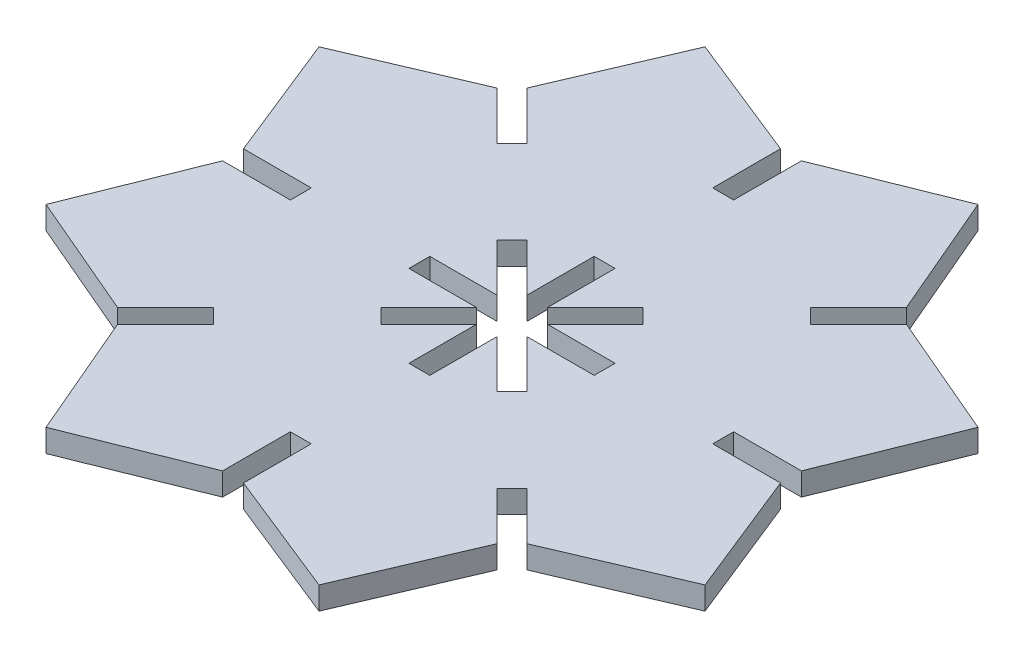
ISO-10303-21;
HEADER;
FILE_DESCRIPTION(('STEP AP214'),'2;1');
FILE_NAME('part.step','',(''),(''),'','','');
FILE_SCHEMA(('AUTOMOTIVE_DESIGN { 1 0 10303 214 1 1 1 1 }'));
ENDSEC;
DATA;
#1=APPLICATION_CONTEXT('core data for automotive mechanical design processes');
#2=APPLICATION_PROTOCOL_DEFINITION('international standard','automotive_design',2000,#1);
#3=PRODUCT_CONTEXT('',#1,'mechanical');
#4=PRODUCT('Part','Part','',(#3));
#5=PRODUCT_RELATED_PRODUCT_CATEGORY('part','',(#4));
#6=PRODUCT_DEFINITION_FORMATION('','',#4);
#7=PRODUCT_DEFINITION_CONTEXT('part definition',#1,'design');
#8=PRODUCT_DEFINITION('design','',#6,#7);
#9=PRODUCT_DEFINITION_SHAPE('','',#8);
#10=(LENGTH_UNIT() NAMED_UNIT(*) SI_UNIT(.MILLI.,.METRE.));
#11=(NAMED_UNIT(*) PLANE_ANGLE_UNIT() SI_UNIT($,.RADIAN.));
#12=(NAMED_UNIT(*) SI_UNIT($,.STERADIAN.) SOLID_ANGLE_UNIT());
#13=UNCERTAINTY_MEASURE_WITH_UNIT(LENGTH_MEASURE(1.E-05),#10,'distance_accuracy_value','');
#14=(GEOMETRIC_REPRESENTATION_CONTEXT(3) GLOBAL_UNCERTAINTY_ASSIGNED_CONTEXT((#13)) GLOBAL_UNIT_ASSIGNED_CONTEXT((#10,
#11,#12)) REPRESENTATION_CONTEXT('',''));
#15=CARTESIAN_POINT('',(0.,0.,0.));
#16=DIRECTION('',(0.,0.,1.));
#17=DIRECTION('',(1.,0.,0.));
#18=AXIS2_PLACEMENT_3D('',#15,#16,#17);
#19=CARTESIAN_POINT('',(0.,1.25,0.));
#20=DIRECTION('',(0.,1.,0.));
#21=DIRECTION('',(0.,0.,1.));
#22=AXIS2_PLACEMENT_3D('',#19,#20,#21);
#23=PLANE('',#22);
#24=DIRECTION('',(-0.707106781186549,0.,-0.707106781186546));
#25=VECTOR('',#24,1.);
#26=CARTESIAN_POINT('',(0.81317279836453,1.25,-0.813172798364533));
#27=LINE('',#26,#25);
#28=CARTESIAN_POINT('',(-1.15,1.25,-2.77634559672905));
#29=VERTEX_POINT('',#28);
#30=CARTESIAN_POINT('',(-6.38674290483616,1.25,-8.0130885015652));
#31=VERTEX_POINT('',#30);
#32=EDGE_CURVE('E585',#29,#31,#27,.T.);
#33=ORIENTED_EDGE('',*,*,#32,.F.);
#34=DIRECTION('',(0.,0.,1.));
#35=VECTOR('',#34,1.);
#36=CARTESIAN_POINT('',(-1.15,1.25,0.));
#37=LINE('',#36,#35);
#38=CARTESIAN_POINT('',(-1.15,1.25,-10.1822184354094));
#39=VERTEX_POINT('',#38);
#40=EDGE_CURVE('E731',#39,#29,#37,.T.);
#41=ORIENTED_EDGE('',*,*,#40,.F.);
#42=DIRECTION('',(-1.,0.,0.));
#43=VECTOR('',#42,1.);
#44=CARTESIAN_POINT('',(0.,1.25,-10.1822184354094));
#45=LINE('',#44,#43);
#46=CARTESIAN_POINT('',(1.15,1.25,-10.1822184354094));
#47=VERTEX_POINT('',#46);
#48=EDGE_CURVE('E857',#47,#39,#45,.T.);
#49=ORIENTED_EDGE('',*,*,#48,.F.);
#50=DIRECTION('',(0.,0.,-1.));
#51=VECTOR('',#50,1.);
#52=CARTESIAN_POINT('',(1.15,1.25,0.));
#53=LINE('',#52,#51);
#54=CARTESIAN_POINT('',(1.15,1.25,-2.77634559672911));
#55=VERTEX_POINT('',#54);
#56=EDGE_CURVE('E709',#55,#47,#53,.T.);
#57=ORIENTED_EDGE('',*,*,#56,.F.);
#58=DIRECTION('',(-0.707106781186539,0.,0.707106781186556));
#59=VECTOR('',#58,1.);
#60=CARTESIAN_POINT('',(-0.813172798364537,1.25,-0.813172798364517));
#61=LINE('',#60,#59);
#62=CARTESIAN_POINT('',(6.38674290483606,1.25,-8.01308850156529));
#63=VERTEX_POINT('',#62);
#64=EDGE_CURVE('E52',#63,#55,#61,.T.);
#65=ORIENTED_EDGE('',*,*,#64,.F.);
#66=DIRECTION('',(-0.707106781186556,0.,-0.707106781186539));
#67=VECTOR('',#66,1.);
#68=CARTESIAN_POINT('',(7.19991570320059,1.25,-7.19991570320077));
#69=LINE('',#68,#67);
#70=CARTESIAN_POINT('',(8.01308850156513,1.25,-6.38674290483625));
#71=VERTEX_POINT('',#70);
#72=EDGE_CURVE('E654',#71,#63,#69,.T.);
#73=ORIENTED_EDGE('',*,*,#72,.F.);
#74=DIRECTION('',(0.707106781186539,0.,-0.707106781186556));
#75=VECTOR('',#74,1.);
#76=CARTESIAN_POINT('',(0.813172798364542,1.25,0.813172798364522));
#77=LINE('',#76,#75);
#78=CARTESIAN_POINT('',(2.77634559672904,1.25,-1.15000000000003));
#79=VERTEX_POINT('',#78);
#80=EDGE_CURVE('E652',#79,#71,#77,.T.);
#81=ORIENTED_EDGE('',*,*,#80,.F.);
#82=DIRECTION('',(-1.,0.,0.));
#83=VECTOR('',#82,1.);
#84=CARTESIAN_POINT('',(0.,1.25,-1.15));
#85=LINE('',#84,#83);
#86=CARTESIAN_POINT('',(10.1822184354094,1.25,-1.1500000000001));
#87=VERTEX_POINT('',#86);
#88=EDGE_CURVE('E660',#87,#79,#85,.T.);
#89=ORIENTED_EDGE('',*,*,#88,.F.);
#90=DIRECTION('',(0.,0.,-1.));
#91=VECTOR('',#90,1.);
#92=CARTESIAN_POINT('',(10.1822184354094,1.25,-1.0665307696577E-13));
#93=LINE('',#92,#91);
#94=CARTESIAN_POINT('',(10.1822184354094,1.25,1.1499999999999));
#95=VERTEX_POINT('',#94);
#96=EDGE_CURVE('E658',#95,#87,#93,.T.);
#97=ORIENTED_EDGE('',*,*,#96,.F.);
#98=DIRECTION('',(1.,0.,0.));
#99=VECTOR('',#98,1.);
#100=CARTESIAN_POINT('',(0.,1.25,1.15));
#101=LINE('',#100,#99);
#102=CARTESIAN_POINT('',(2.77634559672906,1.25,1.14999999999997));
#103=VERTEX_POINT('',#102);
#104=EDGE_CURVE('E656',#103,#95,#101,.T.);
#105=ORIENTED_EDGE('',*,*,#104,.F.);
#106=DIRECTION('',(-0.707106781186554,0.,-0.707106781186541));
#107=VECTOR('',#106,1.);
#108=CARTESIAN_POINT('',(0.81317279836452,1.25,-0.813172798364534));
#109=LINE('',#108,#107);
#110=CARTESIAN_POINT('',(8.01308850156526,1.25,6.38674290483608));
#111=VERTEX_POINT('',#110);
#112=EDGE_CURVE('E666',#111,#103,#109,.T.);
#113=ORIENTED_EDGE('',*,*,#112,.F.);
#114=DIRECTION('',(0.707106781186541,0.,-0.707106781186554));
#115=VECTOR('',#114,1.);
#116=CARTESIAN_POINT('',(7.19991570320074,1.25,7.19991570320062));
#117=LINE('',#116,#115);
#118=CARTESIAN_POINT('',(6.38674290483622,1.25,8.01308850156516));
#119=VERTEX_POINT('',#118);
#120=EDGE_CURVE('E664',#119,#111,#117,.T.);
#121=ORIENTED_EDGE('',*,*,#120,.F.);
#122=DIRECTION('',(0.707106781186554,0.,0.707106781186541));
#123=VECTOR('',#122,1.);
#124=CARTESIAN_POINT('',(-0.813172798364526,1.25,0.81317279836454));
#125=LINE('',#124,#123);
#126=CARTESIAN_POINT('',(1.15,1.25,2.77634559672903));
#127=VERTEX_POINT('',#126);
#128=EDGE_CURVE('E662',#127,#119,#125,.T.);
#129=ORIENTED_EDGE('',*,*,#128,.F.);
#130=DIRECTION('',(0.,0.,-1.));
#131=VECTOR('',#130,1.);
#132=CARTESIAN_POINT('',(1.15,1.25,0.));
#133=LINE('',#132,#131);
#134=CARTESIAN_POINT('',(1.15,1.25,10.1822184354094));
#135=VERTEX_POINT('',#134);
#136=EDGE_CURVE('E672',#135,#127,#133,.T.);
#137=ORIENTED_EDGE('',*,*,#136,.F.);
#138=DIRECTION('',(1.,0.,0.));
#139=VECTOR('',#138,1.);
#140=CARTESIAN_POINT('',(0.,1.25,10.1822184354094));
#141=LINE('',#140,#139);
#142=CARTESIAN_POINT('',(-1.15,1.25,10.1822184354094));
#143=VERTEX_POINT('',#142);
#144=EDGE_CURVE('E670',#143,#135,#141,.T.);
#145=ORIENTED_EDGE('',*,*,#144,.F.);
#146=DIRECTION('',(0.,0.,1.));
#147=VECTOR('',#146,1.);
#148=CARTESIAN_POINT('',(-1.15,1.25,0.));
#149=LINE('',#148,#147);
#150=CARTESIAN_POINT('',(-1.15,1.25,2.77634559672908));
#151=VERTEX_POINT('',#150);
#152=EDGE_CURVE('E668',#151,#143,#149,.T.);
#153=ORIENTED_EDGE('',*,*,#152,.F.);
#154=DIRECTION('',(0.707106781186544,0.,-0.707106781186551));
#155=VECTOR('',#154,1.);
#156=CARTESIAN_POINT('',(0.813172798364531,1.25,0.813172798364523));
#157=LINE('',#156,#155);
#158=CARTESIAN_POINT('',(-6.38674290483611,1.25,8.01308850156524));
#159=VERTEX_POINT('',#158);
#160=EDGE_CURVE('E678',#159,#151,#157,.T.);
#161=ORIENTED_EDGE('',*,*,#160,.F.);
#162=DIRECTION('',(0.707106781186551,0.,0.707106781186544));
#163=VECTOR('',#162,1.);
#164=CARTESIAN_POINT('',(-7.19991570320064,1.25,7.19991570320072));
#165=LINE('',#164,#163);
#166=CARTESIAN_POINT('',(-8.01308850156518,1.25,6.38674290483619));
#167=VERTEX_POINT('',#166);
#168=EDGE_CURVE('E676',#167,#159,#165,.T.);
#169=ORIENTED_EDGE('',*,*,#168,.F.);
#170=DIRECTION('',(-0.707106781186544,0.,0.707106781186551));
#171=VECTOR('',#170,1.);
#172=CARTESIAN_POINT('',(-0.813172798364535,1.25,-0.813172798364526));
#173=LINE('',#172,#171);
#174=CARTESIAN_POINT('',(-2.77634559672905,1.25,1.15000000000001));
#175=VERTEX_POINT('',#174);
#176=EDGE_CURVE('E674',#175,#167,#173,.T.);
#177=ORIENTED_EDGE('',*,*,#176,.F.);
#178=DIRECTION('',(1.,0.,0.));
#179=VECTOR('',#178,1.);
#180=CARTESIAN_POINT('',(0.,1.25,1.15));
#181=LINE('',#180,#179);
#182=CARTESIAN_POINT('',(-10.1822184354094,1.25,1.15000000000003));
#183=VERTEX_POINT('',#182);
#184=EDGE_CURVE('E684',#183,#175,#181,.T.);
#185=ORIENTED_EDGE('',*,*,#184,.F.);
#186=DIRECTION('',(0.,0.,1.));
#187=VECTOR('',#186,1.);
#188=CARTESIAN_POINT('',(-10.1822184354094,1.25,0.));
#189=LINE('',#188,#187);
#190=CARTESIAN_POINT('',(-10.1822184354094,1.25,-1.14999999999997));
#191=VERTEX_POINT('',#190);
#192=EDGE_CURVE('E682',#191,#183,#189,.T.);
#193=ORIENTED_EDGE('',*,*,#192,.F.);
#194=DIRECTION('',(-1.,0.,0.));
#195=VECTOR('',#194,1.);
#196=CARTESIAN_POINT('',(0.,1.25,-1.15));
#197=LINE('',#196,#195);
#198=CARTESIAN_POINT('',(-2.77634559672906,1.25,-1.14999999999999));
#199=VERTEX_POINT('',#198);
#200=EDGE_CURVE('E680',#199,#191,#197,.T.);
#201=ORIENTED_EDGE('',*,*,#200,.F.);
#202=DIRECTION('',(0.707106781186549,0.,0.707106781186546));
#203=VECTOR('',#202,1.);
#204=CARTESIAN_POINT('',(-0.813172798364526,1.25,0.813172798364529));
#205=LINE('',#204,#203);
#206=CARTESIAN_POINT('',(-8.01308850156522,1.25,-6.38674290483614));
#207=VERTEX_POINT('',#206);
#208=EDGE_CURVE('E687',#207,#199,#205,.T.);
#209=ORIENTED_EDGE('',*,*,#208,.F.);
#210=DIRECTION('',(-0.707106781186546,0.,0.707106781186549));
#211=VECTOR('',#210,1.);
#212=CARTESIAN_POINT('',(-7.19991570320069,1.25,-7.19991570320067));
#213=LINE('',#212,#211);
#214=EDGE_CURVE('E532',#31,#207,#213,.T.);
#215=ORIENTED_EDGE('',*,*,#214,.F.);
#216=EDGE_LOOP('',(#33,#41,#49,#57,#65,#73,#81,#89,#97,#105,#113,#121,#129,#137,#145,#153,#161,
#169,#177,#185,#193,#201,#209,#215));
#217=FACE_BOUND('',#216,.T.);
#218=DIRECTION('',(0.393049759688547,0.,-0.919517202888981));
#219=VECTOR('',#218,1.);
#220=CARTESIAN_POINT('',(-25.7753057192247,1.25,-11.017714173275));
#221=LINE('',#220,#219);
#222=CARTESIAN_POINT('',(-20.8691159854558,1.25,-22.4954615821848));
#223=VERTEX_POINT('',#222);
#224=CARTESIAN_POINT('',(-15.0026749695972,1.25,-36.2196613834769));
#225=VERTEX_POINT('',#224);
#226=EDGE_CURVE('E60',#223,#225,#221,.T.);
#227=ORIENTED_EDGE('',*,*,#226,.F.);
#228=DIRECTION('',(-0.707106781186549,0.,-0.707106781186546));
#229=VECTOR('',#228,1.);
#230=CARTESIAN_POINT('',(0.81317279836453,1.25,-0.813172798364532));
#231=LINE('',#230,#229);
#232=CARTESIAN_POINT('',(-15.5997321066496,1.25,-17.2260777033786));
#233=VERTEX_POINT('',#232);
#234=EDGE_CURVE('E453',#233,#223,#231,.T.);
#235=ORIENTED_EDGE('',*,*,#234,.F.);
#236=DIRECTION('',(0.707106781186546,0.,-0.707106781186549));
#237=VECTOR('',#236,1.);
#238=CARTESIAN_POINT('',(-16.4129049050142,1.25,-16.4129049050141));
#239=LINE('',#238,#237);
#240=CARTESIAN_POINT('',(-17.2260777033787,1.25,-15.5997321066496));
#241=VERTEX_POINT('',#240);
#242=EDGE_CURVE('E649',#241,#233,#239,.T.);
#243=ORIENTED_EDGE('',*,*,#242,.F.);
#244=DIRECTION('',(0.707106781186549,0.,0.707106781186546));
#245=VECTOR('',#244,1.);
#246=CARTESIAN_POINT('',(-0.813172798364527,1.25,0.81317279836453));
#247=LINE('',#246,#245);
#248=CARTESIAN_POINT('',(-22.4954615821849,1.25,-20.8691159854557));
#249=VERTEX_POINT('',#248);
#250=EDGE_CURVE('E647',#249,#241,#247,.T.);
#251=ORIENTED_EDGE('',*,*,#250,.F.);
#252=DIRECTION('',(0.91951720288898,0.,-0.39304975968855));
#253=VECTOR('',#252,1.);
#254=CARTESIAN_POINT('',(-11.0177141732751,1.25,-25.7753057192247));
#255=LINE('',#254,#253);
#256=CARTESIAN_POINT('',(-36.219661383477,1.25,-15.0026749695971));
#257=VERTEX_POINT('',#256);
#258=EDGE_CURVE('E645',#257,#249,#255,.T.);
#259=ORIENTED_EDGE('',*,*,#258,.F.);
#260=DIRECTION('',(-0.372268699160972,0.,-0.928124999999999));
#261=VECTOR('',#260,1.);
#262=CARTESIAN_POINT('',(-26.0165938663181,1.25,10.4351930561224));
#263=LINE('',#262,#261);
#264=CARTESIAN_POINT('',(-30.6633868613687,1.25,-1.14999999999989));
#265=VERTEX_POINT('',#264);
#266=EDGE_CURVE('E643',#265,#257,#263,.T.);
#267=ORIENTED_EDGE('',*,*,#266,.F.);
#268=DIRECTION('',(-1.,0.,0.));
#269=VECTOR('',#268,1.);
#270=CARTESIAN_POINT('',(0.,1.25,-1.15));
#271=LINE('',#270,#269);
#272=CARTESIAN_POINT('',(-23.2113527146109,1.25,-1.14999999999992));
#273=VERTEX_POINT('',#272);
#274=EDGE_CURVE('E641',#273,#265,#271,.T.);
#275=ORIENTED_EDGE('',*,*,#274,.F.);
#276=DIRECTION('',(0.,0.,-1.));
#277=VECTOR('',#276,1.);
#278=CARTESIAN_POINT('',(-23.2113527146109,1.25,0.));
#279=LINE('',#278,#277);
#280=CARTESIAN_POINT('',(-23.2113527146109,1.25,1.15000000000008));
#281=VERTEX_POINT('',#280);
#282=EDGE_CURVE('E639',#281,#273,#279,.T.);
#283=ORIENTED_EDGE('',*,*,#282,.F.);
#284=DIRECTION('',(1.,0.,0.));
#285=VECTOR('',#284,1.);
#286=CARTESIAN_POINT('',(0.,1.25,1.15));
#287=LINE('',#286,#285);
#288=CARTESIAN_POINT('',(-30.6633868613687,1.25,1.15000000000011));
#289=VERTEX_POINT('',#288);
#290=EDGE_CURVE('E637',#289,#281,#287,.T.);
#291=ORIENTED_EDGE('',*,*,#290,.F.);
#292=DIRECTION('',(0.372268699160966,0.,-0.928125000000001));
#293=VECTOR('',#292,1.);
#294=CARTESIAN_POINT('',(-26.0165938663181,1.25,-10.4351930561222));
#295=LINE('',#294,#293);
#296=CARTESIAN_POINT('',(-36.2196613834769,1.25,15.0026749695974));
#297=VERTEX_POINT('',#296);
#298=EDGE_CURVE('E635',#297,#289,#295,.T.);
#299=ORIENTED_EDGE('',*,*,#298,.F.);
#300=DIRECTION('',(-0.919517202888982,0.,-0.393049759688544));
#301=VECTOR('',#300,1.);
#302=CARTESIAN_POINT('',(-11.0177141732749,1.25,25.7753057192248));
#303=LINE('',#302,#301);
#304=CARTESIAN_POINT('',(-22.4954615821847,1.25,20.8691159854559));
#305=VERTEX_POINT('',#304);
#306=EDGE_CURVE('E633',#305,#297,#303,.T.);
#307=ORIENTED_EDGE('',*,*,#306,.F.);
#308=DIRECTION('',(-0.707106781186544,0.,0.707106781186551));
#309=VECTOR('',#308,1.);
#310=CARTESIAN_POINT('',(-0.813172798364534,1.25,-0.813172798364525));
#311=LINE('',#310,#309);
#312=CARTESIAN_POINT('',(-17.2260777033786,1.25,15.5997321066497));
#313=VERTEX_POINT('',#312);
#314=EDGE_CURVE('E631',#313,#305,#311,.T.);
#315=ORIENTED_EDGE('',*,*,#314,.F.);
#316=DIRECTION('',(-0.707106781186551,0.,-0.707106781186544));
#317=VECTOR('',#316,1.);
#318=CARTESIAN_POINT('',(-16.412904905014,1.25,16.4129049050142));
#319=LINE('',#318,#317);
#320=CARTESIAN_POINT('',(-15.5997321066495,1.25,17.2260777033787));
#321=VERTEX_POINT('',#320);
#322=EDGE_CURVE('E629',#321,#313,#319,.T.);
#323=ORIENTED_EDGE('',*,*,#322,.F.);
#324=DIRECTION('',(0.707106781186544,0.,-0.707106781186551));
#325=VECTOR('',#324,1.);
#326=CARTESIAN_POINT('',(0.813172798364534,1.25,0.813172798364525));
#327=LINE('',#326,#325);
#328=CARTESIAN_POINT('',(-20.8691159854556,1.25,22.4954615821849));
#329=VERTEX_POINT('',#328);
#330=EDGE_CURVE('E627',#329,#321,#327,.T.);
#331=ORIENTED_EDGE('',*,*,#330,.F.);
#332=DIRECTION('',(-0.393049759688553,0.,-0.919517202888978));
#333=VECTOR('',#332,1.);
#334=CARTESIAN_POINT('',(-25.7753057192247,1.25,11.0177141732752));
#335=LINE('',#334,#333);
#336=CARTESIAN_POINT('',(-15.0026749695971,1.25,36.2196613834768));
#337=VERTEX_POINT('',#336);
#338=EDGE_CURVE('E625',#337,#329,#335,.T.);
#339=ORIENTED_EDGE('',*,*,#338,.F.);
#340=DIRECTION('',(-0.928125,0.,0.372268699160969));
#341=VECTOR('',#340,1.);
#342=CARTESIAN_POINT('',(10.4351930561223,1.25,26.0165938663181));
#343=LINE('',#342,#341);
#344=CARTESIAN_POINT('',(-1.15,1.25,30.6633868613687));
#345=VERTEX_POINT('',#344);
#346=EDGE_CURVE('E623',#345,#337,#343,.T.);
#347=ORIENTED_EDGE('',*,*,#346,.F.);
#348=DIRECTION('',(0.,0.,1.));
#349=VECTOR('',#348,1.);
#350=CARTESIAN_POINT('',(-1.15,1.25,0.));
#351=LINE('',#350,#349);
#352=CARTESIAN_POINT('',(-1.15,1.25,23.2113527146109));
#353=VERTEX_POINT('',#352);
#354=EDGE_CURVE('E621',#353,#345,#351,.T.);
#355=ORIENTED_EDGE('',*,*,#354,.F.);
#356=DIRECTION('',(-1.,0.,0.));
#357=VECTOR('',#356,1.);
#358=CARTESIAN_POINT('',(0.,1.25,23.2113527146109));
#359=LINE('',#358,#357);
#360=CARTESIAN_POINT('',(1.15,1.25,23.2113527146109));
#361=VERTEX_POINT('',#360);
#362=EDGE_CURVE('E619',#361,#353,#359,.T.);
#363=ORIENTED_EDGE('',*,*,#362,.F.);
#364=DIRECTION('',(0.,0.,-1.));
#365=VECTOR('',#364,1.);
#366=CARTESIAN_POINT('',(1.15,1.25,0.));
#367=LINE('',#366,#365);
#368=CARTESIAN_POINT('',(1.15,1.25,30.6633868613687));
#369=VERTEX_POINT('',#368);
#370=EDGE_CURVE('E617',#369,#361,#367,.T.);
#371=ORIENTED_EDGE('',*,*,#370,.F.);
#372=DIRECTION('',(-0.928125,0.,-0.372268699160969));
#373=VECTOR('',#372,1.);
#374=CARTESIAN_POINT('',(-10.4351930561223,1.25,26.0165938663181));
#375=LINE('',#374,#373);
#376=CARTESIAN_POINT('',(15.0026749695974,1.25,36.219661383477));
#377=VERTEX_POINT('',#376);
#378=EDGE_CURVE('E615',#377,#369,#375,.T.);
#379=ORIENTED_EDGE('',*,*,#378,.F.);
#380=DIRECTION('',(-0.39304975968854,0.,0.919517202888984));
#381=VECTOR('',#380,1.);
#382=CARTESIAN_POINT('',(25.7753057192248,1.25,11.0177141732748));
#383=LINE('',#382,#381);
#384=CARTESIAN_POINT('',(20.869115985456,1.25,22.4954615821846));
#385=VERTEX_POINT('',#384);
#386=EDGE_CURVE('E613',#385,#377,#383,.T.);
#387=ORIENTED_EDGE('',*,*,#386,.F.);
#388=DIRECTION('',(0.707106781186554,0.,0.707106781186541));
#389=VECTOR('',#388,1.);
#390=CARTESIAN_POINT('',(-0.813172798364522,1.25,0.813172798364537));
#391=LINE('',#390,#389);
#392=CARTESIAN_POINT('',(15.5997321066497,1.25,17.2260777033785));
#393=VERTEX_POINT('',#392);
#394=EDGE_CURVE('E611',#393,#385,#391,.T.);
#395=ORIENTED_EDGE('',*,*,#394,.F.);
#396=DIRECTION('',(-0.707106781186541,0.,0.707106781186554));
#397=VECTOR('',#396,1.);
#398=CARTESIAN_POINT('',(16.4129049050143,1.25,16.412904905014));
#399=LINE('',#398,#397);
#400=CARTESIAN_POINT('',(17.2260777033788,1.25,15.5997321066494));
#401=VERTEX_POINT('',#400);
#402=EDGE_CURVE('E609',#401,#393,#399,.T.);
#403=ORIENTED_EDGE('',*,*,#402,.F.);
#404=DIRECTION('',(-0.707106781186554,0.,-0.707106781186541));
#405=VECTOR('',#404,1.);
#406=CARTESIAN_POINT('',(0.81317279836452,1.25,-0.813172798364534));
#407=LINE('',#406,#405);
#408=CARTESIAN_POINT('',(22.495461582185,1.25,20.8691159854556));
#409=VERTEX_POINT('',#408);
#410=EDGE_CURVE('E607',#409,#401,#407,.T.);
#411=ORIENTED_EDGE('',*,*,#410,.F.);
#412=DIRECTION('',(-0.919517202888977,0.,0.393049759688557));
#413=VECTOR('',#412,1.);
#414=CARTESIAN_POINT('',(11.0177141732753,1.25,25.7753057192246));
#415=LINE('',#414,#413);
#416=CARTESIAN_POINT('',(36.2196613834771,1.25,15.0026749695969));
#417=VERTEX_POINT('',#416);
#418=EDGE_CURVE('E605',#417,#409,#415,.T.);
#419=ORIENTED_EDGE('',*,*,#418,.F.);
#420=DIRECTION('',(0.372268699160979,0.,0.928124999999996));
#421=VECTOR('',#420,1.);
#422=CARTESIAN_POINT('',(26.016593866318,1.25,-10.4351930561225));
#423=LINE('',#422,#421);
#424=CARTESIAN_POINT('',(30.6633868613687,1.25,1.14999999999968));
#425=VERTEX_POINT('',#424);
#426=EDGE_CURVE('E603',#425,#417,#423,.T.);
#427=ORIENTED_EDGE('',*,*,#426,.F.);
#428=DIRECTION('',(1.,0.,0.));
#429=VECTOR('',#428,1.);
#430=CARTESIAN_POINT('',(0.,1.25,1.15));
#431=LINE('',#430,#429);
#432=CARTESIAN_POINT('',(23.2113527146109,1.25,1.14999999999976));
#433=VERTEX_POINT('',#432);
#434=EDGE_CURVE('E601',#433,#425,#431,.T.);
#435=ORIENTED_EDGE('',*,*,#434,.F.);
#436=DIRECTION('',(0.,0.,1.));
#437=VECTOR('',#436,1.);
#438=CARTESIAN_POINT('',(23.2113527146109,1.25,-2.43126014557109E-13));
#439=LINE('',#438,#437);
#440=CARTESIAN_POINT('',(23.2113527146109,1.25,-1.15000000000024));
#441=VERTEX_POINT('',#440);
#442=EDGE_CURVE('E599',#441,#433,#439,.T.);
#443=ORIENTED_EDGE('',*,*,#442,.F.);
#444=DIRECTION('',(-1.,0.,0.));
#445=VECTOR('',#444,1.);
#446=CARTESIAN_POINT('',(0.,1.25,-1.15));
#447=LINE('',#446,#445);
#448=CARTESIAN_POINT('',(30.6633868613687,1.25,-1.15000000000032));
#449=VERTEX_POINT('',#448);
#450=EDGE_CURVE('E597',#449,#441,#447,.T.);
#451=ORIENTED_EDGE('',*,*,#450,.F.);
#452=DIRECTION('',(-0.372268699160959,0.,0.928125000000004));
#453=VECTOR('',#452,1.);
#454=CARTESIAN_POINT('',(26.0165938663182,1.25,10.435193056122));
#455=LINE('',#454,#453);
#456=CARTESIAN_POINT('',(36.2196613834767,1.25,-15.0026749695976));
#457=VERTEX_POINT('',#456);
#458=EDGE_CURVE('E595',#457,#449,#455,.T.);
#459=ORIENTED_EDGE('',*,*,#458,.F.);
#460=DIRECTION('',(0.919517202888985,0.,0.393049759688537));
#461=VECTOR('',#460,1.);
#462=CARTESIAN_POINT('',(11.0177141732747,1.25,-25.7753057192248));
#463=LINE('',#462,#461);
#464=CARTESIAN_POINT('',(22.4954615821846,1.25,-20.869115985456));
#465=VERTEX_POINT('',#464);
#466=EDGE_CURVE('E593',#465,#457,#463,.T.);
#467=ORIENTED_EDGE('',*,*,#466,.F.);
#468=DIRECTION('',(0.707106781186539,0.,-0.707106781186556));
#469=VECTOR('',#468,1.);
#470=CARTESIAN_POINT('',(0.81317279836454,1.25,0.81317279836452));
#471=LINE('',#470,#469);
#472=CARTESIAN_POINT('',(17.2260777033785,1.25,-15.5997321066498));
#473=VERTEX_POINT('',#472);
#474=EDGE_CURVE('E591',#473,#465,#471,.T.);
#475=ORIENTED_EDGE('',*,*,#474,.F.);
#476=DIRECTION('',(0.707106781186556,0.,0.707106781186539));
#477=VECTOR('',#476,1.);
#478=CARTESIAN_POINT('',(16.4129049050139,1.25,-16.4129049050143));
#479=LINE('',#478,#477);
#480=CARTESIAN_POINT('',(15.5997321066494,1.25,-17.2260777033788));
#481=VERTEX_POINT('',#480);
#482=EDGE_CURVE('E589',#481,#473,#479,.T.);
#483=ORIENTED_EDGE('',*,*,#482,.F.);
#484=DIRECTION('',(-0.707106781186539,0.,0.707106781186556));
#485=VECTOR('',#484,1.);
#486=CARTESIAN_POINT('',(-0.813172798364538,1.25,-0.813172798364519));
#487=LINE('',#486,#485);
#488=CARTESIAN_POINT('',(20.8691159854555,1.25,-22.4954615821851));
#489=VERTEX_POINT('',#488);
#490=EDGE_CURVE('E587',#489,#481,#487,.T.);
#491=ORIENTED_EDGE('',*,*,#490,.F.);
#492=DIRECTION('',(0.39304975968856,0.,0.919517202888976));
#493=VECTOR('',#492,1.);
#494=CARTESIAN_POINT('',(25.7753057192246,1.25,-11.0177141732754));
#495=LINE('',#494,#493);
#496=CARTESIAN_POINT('',(15.0026749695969,1.25,-36.2196613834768));
#497=VERTEX_POINT('',#496);
#498=EDGE_CURVE('E577',#497,#489,#495,.T.);
#499=ORIENTED_EDGE('',*,*,#498,.F.);
#500=DIRECTION('',(0.928125,0.,-0.372268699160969));
#501=VECTOR('',#500,1.);
#502=CARTESIAN_POINT('',(-10.4351930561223,1.25,-26.0165938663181));
#503=LINE('',#502,#501);
#504=CARTESIAN_POINT('',(1.15,1.25,-30.6633868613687));
#505=VERTEX_POINT('',#504);
#506=EDGE_CURVE('E854',#505,#497,#503,.T.);
#507=ORIENTED_EDGE('',*,*,#506,.F.);
#508=DIRECTION('',(0.,0.,-1.));
#509=VECTOR('',#508,1.);
#510=CARTESIAN_POINT('',(1.15,1.25,0.));
#511=LINE('',#510,#509);
#512=CARTESIAN_POINT('',(1.15,1.25,-23.2113527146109));
#513=VERTEX_POINT('',#512);
#514=EDGE_CURVE('E866',#513,#505,#511,.T.);
#515=ORIENTED_EDGE('',*,*,#514,.F.);
#516=DIRECTION('',(1.,0.,0.));
#517=VECTOR('',#516,1.);
#518=CARTESIAN_POINT('',(0.,1.25,-23.2113527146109));
#519=LINE('',#518,#517);
#520=CARTESIAN_POINT('',(-1.15,1.25,-23.2113527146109));
#521=VERTEX_POINT('',#520);
#522=EDGE_CURVE('E864',#521,#513,#519,.T.);
#523=ORIENTED_EDGE('',*,*,#522,.F.);
#524=DIRECTION('',(0.,0.,1.));
#525=VECTOR('',#524,1.);
#526=CARTESIAN_POINT('',(-1.15,1.25,0.));
#527=LINE('',#526,#525);
#528=CARTESIAN_POINT('',(-1.15,1.25,-30.6633868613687));
#529=VERTEX_POINT('',#528);
#530=EDGE_CURVE('E851',#529,#521,#527,.T.);
#531=ORIENTED_EDGE('',*,*,#530,.F.);
#532=DIRECTION('',(0.928125,0.,0.372268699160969));
#533=VECTOR('',#532,1.);
#534=CARTESIAN_POINT('',(10.4351930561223,1.25,-26.0165938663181));
#535=LINE('',#534,#533);
#536=EDGE_CURVE('E849',#225,#529,#535,.T.);
#537=ORIENTED_EDGE('',*,*,#536,.F.);
#538=EDGE_LOOP('',(#227,#235,#243,#251,#259,#267,#275,#283,#291,#299,#307,#315,#323,#331,#339,
#347,#355,#363,#371,#379,#387,#395,#403,#411,#419,#427,#435,#443,#451,#459,#467,#475,#483,#491,
#499,#507,#515,#523,#531,#537));
#539=FACE_BOUND('',#538,.T.);
#540=ADVANCED_FACE('F37',(#217,#539),#23,.T.);
#541=CARTESIAN_POINT('',(0.,-1.25,0.));
#542=DIRECTION('',(0.,1.,0.));
#543=DIRECTION('',(0.,0.,1.));
#544=AXIS2_PLACEMENT_3D('',#541,#542,#543);
#545=PLANE('',#544);
#546=DIRECTION('',(0.,0.,1.));
#547=VECTOR('',#546,1.);
#548=CARTESIAN_POINT('',(-1.15,-1.25,-2.73018428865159));
#549=LINE('',#548,#547);
#550=CARTESIAN_POINT('',(-1.15,-1.25,-10.1822184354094));
#551=VERTEX_POINT('',#550);
#552=CARTESIAN_POINT('',(-1.15,-1.25,-2.77634559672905));
#553=VERTEX_POINT('',#552);
#554=EDGE_CURVE('E721',#551,#553,#549,.T.);
#555=ORIENTED_EDGE('',*,*,#554,.T.);
#556=DIRECTION('',(-0.707106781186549,0.,-0.707106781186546));
#557=VECTOR('',#556,1.);
#558=CARTESIAN_POINT('',(0.81317279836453,-1.25,-0.813172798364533));
#559=LINE('',#558,#557);
#560=CARTESIAN_POINT('',(-6.38674290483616,-1.25,-8.0130885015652));
#561=VERTEX_POINT('',#560);
#562=EDGE_CURVE('E583',#553,#561,#559,.T.);
#563=ORIENTED_EDGE('',*,*,#562,.T.);
#564=DIRECTION('',(-0.707106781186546,0.,0.707106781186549));
#565=VECTOR('',#564,1.);
#566=CARTESIAN_POINT('',(-7.19991570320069,-1.25,-7.19991570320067));
#567=LINE('',#566,#565);
#568=CARTESIAN_POINT('',(-8.01308850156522,-1.25,-6.38674290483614));
#569=VERTEX_POINT('',#568);
#570=EDGE_CURVE('E11',#561,#569,#567,.T.);
#571=ORIENTED_EDGE('',*,*,#570,.T.);
#572=DIRECTION('',(0.707106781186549,0.,0.707106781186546));
#573=VECTOR('',#572,1.);
#574=CARTESIAN_POINT('',(-0.813172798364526,-1.25,0.813172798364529));
#575=LINE('',#574,#573);
#576=CARTESIAN_POINT('',(-2.77634559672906,-1.25,-1.14999999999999));
#577=VERTEX_POINT('',#576);
#578=EDGE_CURVE('E45',#569,#577,#575,.T.);
#579=ORIENTED_EDGE('',*,*,#578,.T.);
#580=DIRECTION('',(-1.,0.,0.));
#581=VECTOR('',#580,1.);
#582=CARTESIAN_POINT('',(0.,-1.25,-1.15));
#583=LINE('',#582,#581);
#584=CARTESIAN_POINT('',(-10.1822184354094,-1.25,-1.14999999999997));
#585=VERTEX_POINT('',#584);
#586=EDGE_CURVE('E512',#577,#585,#583,.T.);
#587=ORIENTED_EDGE('',*,*,#586,.T.);
#588=DIRECTION('',(0.,0.,1.));
#589=VECTOR('',#588,1.);
#590=CARTESIAN_POINT('',(-10.1822184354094,-1.25,0.));
#591=LINE('',#590,#589);
#592=CARTESIAN_POINT('',(-10.1822184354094,-1.25,1.15000000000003));
#593=VERTEX_POINT('',#592);
#594=EDGE_CURVE('E509',#585,#593,#591,.T.);
#595=ORIENTED_EDGE('',*,*,#594,.T.);
#596=DIRECTION('',(1.,0.,0.));
#597=VECTOR('',#596,1.);
#598=CARTESIAN_POINT('',(0.,-1.25,1.15));
#599=LINE('',#598,#597);
#600=CARTESIAN_POINT('',(-2.77634559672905,-1.25,1.15000000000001));
#601=VERTEX_POINT('',#600);
#602=EDGE_CURVE('E506',#593,#601,#599,.T.);
#603=ORIENTED_EDGE('',*,*,#602,.T.);
#604=DIRECTION('',(-0.707106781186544,0.,0.707106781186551));
#605=VECTOR('',#604,1.);
#606=CARTESIAN_POINT('',(-0.813172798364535,-1.25,-0.813172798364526));
#607=LINE('',#606,#605);
#608=CARTESIAN_POINT('',(-8.01308850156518,-1.25,6.38674290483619));
#609=VERTEX_POINT('',#608);
#610=EDGE_CURVE('E503',#601,#609,#607,.T.);
#611=ORIENTED_EDGE('',*,*,#610,.T.);
#612=DIRECTION('',(0.707106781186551,0.,0.707106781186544));
#613=VECTOR('',#612,1.);
#614=CARTESIAN_POINT('',(-7.19991570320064,-1.25,7.19991570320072));
#615=LINE('',#614,#613);
#616=CARTESIAN_POINT('',(-6.38674290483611,-1.25,8.01308850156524));
#617=VERTEX_POINT('',#616);
#618=EDGE_CURVE('E500',#609,#617,#615,.T.);
#619=ORIENTED_EDGE('',*,*,#618,.T.);
#620=DIRECTION('',(0.707106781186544,0.,-0.707106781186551));
#621=VECTOR('',#620,1.);
#622=CARTESIAN_POINT('',(0.813172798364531,-1.25,0.813172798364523));
#623=LINE('',#622,#621);
#624=CARTESIAN_POINT('',(-1.15,-1.25,2.77634559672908));
#625=VERTEX_POINT('',#624);
#626=EDGE_CURVE('E497',#617,#625,#623,.T.);
#627=ORIENTED_EDGE('',*,*,#626,.T.);
#628=DIRECTION('',(0.,0.,1.));
#629=VECTOR('',#628,1.);
#630=CARTESIAN_POINT('',(-1.15,-1.25,0.));
#631=LINE('',#630,#629);
#632=CARTESIAN_POINT('',(-1.15,-1.25,10.1822184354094));
#633=VERTEX_POINT('',#632);
#634=EDGE_CURVE('E494',#625,#633,#631,.T.);
#635=ORIENTED_EDGE('',*,*,#634,.T.);
#636=DIRECTION('',(1.,0.,0.));
#637=VECTOR('',#636,1.);
#638=CARTESIAN_POINT('',(0.,-1.25,10.1822184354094));
#639=LINE('',#638,#637);
#640=CARTESIAN_POINT('',(1.15,-1.25,10.1822184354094));
#641=VERTEX_POINT('',#640);
#642=EDGE_CURVE('E491',#633,#641,#639,.T.);
#643=ORIENTED_EDGE('',*,*,#642,.T.);
#644=DIRECTION('',(0.,0.,-1.));
#645=VECTOR('',#644,1.);
#646=CARTESIAN_POINT('',(1.15,-1.25,0.));
#647=LINE('',#646,#645);
#648=CARTESIAN_POINT('',(1.15,-1.25,2.77634559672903));
#649=VERTEX_POINT('',#648);
#650=EDGE_CURVE('E488',#641,#649,#647,.T.);
#651=ORIENTED_EDGE('',*,*,#650,.T.);
#652=DIRECTION('',(0.707106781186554,0.,0.707106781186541));
#653=VECTOR('',#652,1.);
#654=CARTESIAN_POINT('',(-0.813172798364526,-1.25,0.81317279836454));
#655=LINE('',#654,#653);
#656=CARTESIAN_POINT('',(6.38674290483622,-1.25,8.01308850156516));
#657=VERTEX_POINT('',#656);
#658=EDGE_CURVE('E485',#649,#657,#655,.T.);
#659=ORIENTED_EDGE('',*,*,#658,.T.);
#660=DIRECTION('',(0.707106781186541,0.,-0.707106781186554));
#661=VECTOR('',#660,1.);
#662=CARTESIAN_POINT('',(7.19991570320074,-1.25,7.19991570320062));
#663=LINE('',#662,#661);
#664=CARTESIAN_POINT('',(8.01308850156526,-1.25,6.38674290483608));
#665=VERTEX_POINT('',#664);
#666=EDGE_CURVE('E482',#657,#665,#663,.T.);
#667=ORIENTED_EDGE('',*,*,#666,.T.);
#668=DIRECTION('',(-0.707106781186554,0.,-0.707106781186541));
#669=VECTOR('',#668,1.);
#670=CARTESIAN_POINT('',(0.81317279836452,-1.25,-0.813172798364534));
#671=LINE('',#670,#669);
#672=CARTESIAN_POINT('',(2.77634559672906,-1.25,1.14999999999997));
#673=VERTEX_POINT('',#672);
#674=EDGE_CURVE('E479',#665,#673,#671,.T.);
#675=ORIENTED_EDGE('',*,*,#674,.T.);
#676=DIRECTION('',(1.,0.,0.));
#677=VECTOR('',#676,1.);
#678=CARTESIAN_POINT('',(0.,-1.25,1.15));
#679=LINE('',#678,#677);
#680=CARTESIAN_POINT('',(10.1822184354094,-1.25,1.1499999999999));
#681=VERTEX_POINT('',#680);
#682=EDGE_CURVE('E476',#673,#681,#679,.T.);
#683=ORIENTED_EDGE('',*,*,#682,.T.);
#684=DIRECTION('',(0.,0.,-1.));
#685=VECTOR('',#684,1.);
#686=CARTESIAN_POINT('',(10.1822184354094,-1.25,-1.0665307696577E-13));
#687=LINE('',#686,#685);
#688=CARTESIAN_POINT('',(10.1822184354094,-1.25,-1.1500000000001));
#689=VERTEX_POINT('',#688);
#690=EDGE_CURVE('E473',#681,#689,#687,.T.);
#691=ORIENTED_EDGE('',*,*,#690,.T.);
#692=DIRECTION('',(-1.,0.,0.));
#693=VECTOR('',#692,1.);
#694=CARTESIAN_POINT('',(0.,-1.25,-1.15));
#695=LINE('',#694,#693);
#696=CARTESIAN_POINT('',(2.77634559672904,-1.25,-1.15000000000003));
#697=VERTEX_POINT('',#696);
#698=EDGE_CURVE('E470',#689,#697,#695,.T.);
#699=ORIENTED_EDGE('',*,*,#698,.T.);
#700=DIRECTION('',(0.707106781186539,0.,-0.707106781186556));
#701=VECTOR('',#700,1.);
#702=CARTESIAN_POINT('',(0.813172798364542,-1.25,0.813172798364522));
#703=LINE('',#702,#701);
#704=CARTESIAN_POINT('',(8.01308850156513,-1.25,-6.38674290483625));
#705=VERTEX_POINT('',#704);
#706=EDGE_CURVE('E459',#697,#705,#703,.T.);
#707=ORIENTED_EDGE('',*,*,#706,.T.);
#708=DIRECTION('',(-0.707106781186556,0.,-0.707106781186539));
#709=VECTOR('',#708,1.);
#710=CARTESIAN_POINT('',(7.19991570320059,-1.25,-7.19991570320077));
#711=LINE('',#710,#709);
#712=CARTESIAN_POINT('',(6.38674290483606,-1.25,-8.01308850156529));
#713=VERTEX_POINT('',#712);
#714=EDGE_CURVE('E462',#705,#713,#711,.T.);
#715=ORIENTED_EDGE('',*,*,#714,.T.);
#716=DIRECTION('',(-0.707106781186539,0.,0.707106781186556));
#717=VECTOR('',#716,1.);
#718=CARTESIAN_POINT('',(-0.813172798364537,-1.25,-0.813172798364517));
#719=LINE('',#718,#717);
#720=CARTESIAN_POINT('',(1.15,-1.25,-2.77634559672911));
#721=VERTEX_POINT('',#720);
#722=EDGE_CURVE('E579',#713,#721,#719,.T.);
#723=ORIENTED_EDGE('',*,*,#722,.T.);
#724=DIRECTION('',(0.,0.,-1.));
#725=VECTOR('',#724,1.);
#726=CARTESIAN_POINT('',(1.15,-1.25,-10.1822184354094));
#727=LINE('',#726,#725);
#728=CARTESIAN_POINT('',(1.15,-1.25,-10.1822184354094));
#729=VERTEX_POINT('',#728);
#730=EDGE_CURVE('E693',#721,#729,#727,.T.);
#731=ORIENTED_EDGE('',*,*,#730,.T.);
#732=DIRECTION('',(-1.,0.,0.));
#733=VECTOR('',#732,1.);
#734=CARTESIAN_POINT('',(-1.15,-1.25,-10.1822184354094));
#735=LINE('',#734,#733);
#736=EDGE_CURVE('E725',#729,#551,#735,.T.);
#737=ORIENTED_EDGE('',*,*,#736,.T.);
#738=EDGE_LOOP('',(#555,#563,#571,#579,#587,#595,#603,#611,#619,#627,#635,#643,#651,#659,#667,
#675,#683,#691,#699,#707,#715,#723,#731,#737));
#739=FACE_BOUND('',#738,.T.);
#740=DIRECTION('',(-0.707106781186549,0.,-0.707106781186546));
#741=VECTOR('',#740,1.);
#742=CARTESIAN_POINT('',(0.81317279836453,-1.25,-0.813172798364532));
#743=LINE('',#742,#741);
#744=CARTESIAN_POINT('',(-15.5997321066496,-1.25,-17.2260777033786));
#745=VERTEX_POINT('',#744);
#746=CARTESIAN_POINT('',(-20.8691159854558,-1.25,-22.4954615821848));
#747=VERTEX_POINT('',#746);
#748=EDGE_CURVE('E450',#745,#747,#743,.T.);
#749=ORIENTED_EDGE('',*,*,#748,.T.);
#750=DIRECTION('',(0.393049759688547,0.,-0.919517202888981));
#751=VECTOR('',#750,1.);
#752=CARTESIAN_POINT('',(-25.7753057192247,-1.25,-11.017714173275));
#753=LINE('',#752,#751);
#754=CARTESIAN_POINT('',(-15.0026749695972,-1.25,-36.2196613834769));
#755=VERTEX_POINT('',#754);
#756=EDGE_CURVE('E438',#747,#755,#753,.T.);
#757=ORIENTED_EDGE('',*,*,#756,.T.);
#758=DIRECTION('',(0.928125,0.,0.372268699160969));
#759=VECTOR('',#758,1.);
#760=CARTESIAN_POINT('',(-16.,-1.25,-36.6196860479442));
#761=LINE('',#760,#759);
#762=CARTESIAN_POINT('',(-1.15,-1.25,-30.6633868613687));
#763=VERTEX_POINT('',#762);
#764=EDGE_CURVE('E690',#755,#763,#761,.T.);
#765=ORIENTED_EDGE('',*,*,#764,.T.);
#766=DIRECTION('',(0.,0.,1.));
#767=VECTOR('',#766,1.);
#768=CARTESIAN_POINT('',(-1.15,-1.25,-30.6633868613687));
#769=LINE('',#768,#767);
#770=CARTESIAN_POINT('',(-1.15,-1.25,-23.2113527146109));
#771=VERTEX_POINT('',#770);
#772=EDGE_CURVE('E692',#763,#771,#769,.T.);
#773=ORIENTED_EDGE('',*,*,#772,.T.);
#774=DIRECTION('',(1.,0.,0.));
#775=VECTOR('',#774,1.);
#776=CARTESIAN_POINT('',(-1.15,-1.25,-23.2113527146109));
#777=LINE('',#776,#775);
#778=CARTESIAN_POINT('',(1.15,-1.25,-23.2113527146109));
#779=VERTEX_POINT('',#778);
#780=EDGE_CURVE('E696',#771,#779,#777,.T.);
#781=ORIENTED_EDGE('',*,*,#780,.T.);
#782=DIRECTION('',(0.,0.,-1.));
#783=VECTOR('',#782,1.);
#784=CARTESIAN_POINT('',(1.15,-1.25,-23.2113527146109));
#785=LINE('',#784,#783);
#786=CARTESIAN_POINT('',(1.15,-1.25,-30.6633868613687));
#787=VERTEX_POINT('',#786);
#788=EDGE_CURVE('E699',#779,#787,#785,.T.);
#789=ORIENTED_EDGE('',*,*,#788,.T.);
#790=DIRECTION('',(0.928125,0.,-0.372268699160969));
#791=VECTOR('',#790,1.);
#792=CARTESIAN_POINT('',(1.15,-1.25,-30.6633868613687));
#793=LINE('',#792,#791);
#794=CARTESIAN_POINT('',(15.0026749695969,-1.25,-36.2196613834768));
#795=VERTEX_POINT('',#794);
#796=EDGE_CURVE('E702',#787,#795,#793,.T.);
#797=ORIENTED_EDGE('',*,*,#796,.T.);
#798=DIRECTION('',(0.39304975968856,0.,0.919517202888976));
#799=VECTOR('',#798,1.);
#800=CARTESIAN_POINT('',(25.7753057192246,-1.25,-11.0177141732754));
#801=LINE('',#800,#799);
#802=CARTESIAN_POINT('',(20.8691159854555,-1.25,-22.4954615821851));
#803=VERTEX_POINT('',#802);
#804=EDGE_CURVE('E574',#795,#803,#801,.T.);
#805=ORIENTED_EDGE('',*,*,#804,.T.);
#806=DIRECTION('',(-0.707106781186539,0.,0.707106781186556));
#807=VECTOR('',#806,1.);
#808=CARTESIAN_POINT('',(-0.813172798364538,-1.25,-0.813172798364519));
#809=LINE('',#808,#807);
#810=CARTESIAN_POINT('',(15.5997321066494,-1.25,-17.2260777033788));
#811=VERTEX_POINT('',#810);
#812=EDGE_CURVE('E743',#803,#811,#809,.T.);
#813=ORIENTED_EDGE('',*,*,#812,.T.);
#814=DIRECTION('',(0.707106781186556,0.,0.707106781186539));
#815=VECTOR('',#814,1.);
#816=CARTESIAN_POINT('',(16.4129049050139,-1.25,-16.4129049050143));
#817=LINE('',#816,#815);
#818=CARTESIAN_POINT('',(17.2260777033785,-1.25,-15.5997321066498));
#819=VERTEX_POINT('',#818);
#820=EDGE_CURVE('E746',#811,#819,#817,.T.);
#821=ORIENTED_EDGE('',*,*,#820,.T.);
#822=DIRECTION('',(0.707106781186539,0.,-0.707106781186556));
#823=VECTOR('',#822,1.);
#824=CARTESIAN_POINT('',(0.81317279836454,-1.25,0.81317279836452));
#825=LINE('',#824,#823);
#826=CARTESIAN_POINT('',(22.4954615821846,-1.25,-20.869115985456));
#827=VERTEX_POINT('',#826);
#828=EDGE_CURVE('E749',#819,#827,#825,.T.);
#829=ORIENTED_EDGE('',*,*,#828,.T.);
#830=DIRECTION('',(0.919517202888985,0.,0.393049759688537));
#831=VECTOR('',#830,1.);
#832=CARTESIAN_POINT('',(11.0177141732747,-1.25,-25.7753057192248));
#833=LINE('',#832,#831);
#834=CARTESIAN_POINT('',(36.2196613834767,-1.25,-15.0026749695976));
#835=VERTEX_POINT('',#834);
#836=EDGE_CURVE('E752',#827,#835,#833,.T.);
#837=ORIENTED_EDGE('',*,*,#836,.T.);
#838=DIRECTION('',(-0.372268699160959,0.,0.928125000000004));
#839=VECTOR('',#838,1.);
#840=CARTESIAN_POINT('',(26.0165938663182,-1.25,10.435193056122));
#841=LINE('',#840,#839);
#842=CARTESIAN_POINT('',(30.6633868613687,-1.25,-1.15000000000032));
#843=VERTEX_POINT('',#842);
#844=EDGE_CURVE('E755',#835,#843,#841,.T.);
#845=ORIENTED_EDGE('',*,*,#844,.T.);
#846=DIRECTION('',(-1.,0.,0.));
#847=VECTOR('',#846,1.);
#848=CARTESIAN_POINT('',(0.,-1.25,-1.15));
#849=LINE('',#848,#847);
#850=CARTESIAN_POINT('',(23.2113527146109,-1.25,-1.15000000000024));
#851=VERTEX_POINT('',#850);
#852=EDGE_CURVE('E758',#843,#851,#849,.T.);
#853=ORIENTED_EDGE('',*,*,#852,.T.);
#854=DIRECTION('',(0.,0.,1.));
#855=VECTOR('',#854,1.);
#856=CARTESIAN_POINT('',(23.2113527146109,-1.25,-2.43126014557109E-13));
#857=LINE('',#856,#855);
#858=CARTESIAN_POINT('',(23.2113527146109,-1.25,1.14999999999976));
#859=VERTEX_POINT('',#858);
#860=EDGE_CURVE('E761',#851,#859,#857,.T.);
#861=ORIENTED_EDGE('',*,*,#860,.T.);
#862=DIRECTION('',(1.,0.,0.));
#863=VECTOR('',#862,1.);
#864=CARTESIAN_POINT('',(0.,-1.25,1.15));
#865=LINE('',#864,#863);
#866=CARTESIAN_POINT('',(30.6633868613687,-1.25,1.14999999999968));
#867=VERTEX_POINT('',#866);
#868=EDGE_CURVE('E764',#859,#867,#865,.T.);
#869=ORIENTED_EDGE('',*,*,#868,.T.);
#870=DIRECTION('',(0.372268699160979,0.,0.928124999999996));
#871=VECTOR('',#870,1.);
#872=CARTESIAN_POINT('',(26.016593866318,-1.25,-10.4351930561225));
#873=LINE('',#872,#871);
#874=CARTESIAN_POINT('',(36.2196613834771,-1.25,15.0026749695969));
#875=VERTEX_POINT('',#874);
#876=EDGE_CURVE('E767',#867,#875,#873,.T.);
#877=ORIENTED_EDGE('',*,*,#876,.T.);
#878=DIRECTION('',(-0.919517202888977,0.,0.393049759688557));
#879=VECTOR('',#878,1.);
#880=CARTESIAN_POINT('',(11.0177141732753,-1.25,25.7753057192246));
#881=LINE('',#880,#879);
#882=CARTESIAN_POINT('',(22.495461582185,-1.25,20.8691159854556));
#883=VERTEX_POINT('',#882);
#884=EDGE_CURVE('E770',#875,#883,#881,.T.);
#885=ORIENTED_EDGE('',*,*,#884,.T.);
#886=DIRECTION('',(-0.707106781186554,0.,-0.707106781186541));
#887=VECTOR('',#886,1.);
#888=CARTESIAN_POINT('',(0.81317279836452,-1.25,-0.813172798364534));
#889=LINE('',#888,#887);
#890=CARTESIAN_POINT('',(17.2260777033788,-1.25,15.5997321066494));
#891=VERTEX_POINT('',#890);
#892=EDGE_CURVE('E773',#883,#891,#889,.T.);
#893=ORIENTED_EDGE('',*,*,#892,.T.);
#894=DIRECTION('',(-0.707106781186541,0.,0.707106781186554));
#895=VECTOR('',#894,1.);
#896=CARTESIAN_POINT('',(16.4129049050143,-1.25,16.412904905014));
#897=LINE('',#896,#895);
#898=CARTESIAN_POINT('',(15.5997321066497,-1.25,17.2260777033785));
#899=VERTEX_POINT('',#898);
#900=EDGE_CURVE('E776',#891,#899,#897,.T.);
#901=ORIENTED_EDGE('',*,*,#900,.T.);
#902=DIRECTION('',(0.707106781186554,0.,0.707106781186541));
#903=VECTOR('',#902,1.);
#904=CARTESIAN_POINT('',(-0.813172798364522,-1.25,0.813172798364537));
#905=LINE('',#904,#903);
#906=CARTESIAN_POINT('',(20.869115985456,-1.25,22.4954615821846));
#907=VERTEX_POINT('',#906);
#908=EDGE_CURVE('E779',#899,#907,#905,.T.);
#909=ORIENTED_EDGE('',*,*,#908,.T.);
#910=DIRECTION('',(-0.39304975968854,0.,0.919517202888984));
#911=VECTOR('',#910,1.);
#912=CARTESIAN_POINT('',(25.7753057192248,-1.25,11.0177141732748));
#913=LINE('',#912,#911);
#914=CARTESIAN_POINT('',(15.0026749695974,-1.25,36.219661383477));
#915=VERTEX_POINT('',#914);
#916=EDGE_CURVE('E782',#907,#915,#913,.T.);
#917=ORIENTED_EDGE('',*,*,#916,.T.);
#918=DIRECTION('',(-0.928125,0.,-0.372268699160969));
#919=VECTOR('',#918,1.);
#920=CARTESIAN_POINT('',(-10.4351930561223,-1.25,26.0165938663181));
#921=LINE('',#920,#919);
#922=CARTESIAN_POINT('',(1.15,-1.25,30.6633868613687));
#923=VERTEX_POINT('',#922);
#924=EDGE_CURVE('E785',#915,#923,#921,.T.);
#925=ORIENTED_EDGE('',*,*,#924,.T.);
#926=DIRECTION('',(0.,0.,-1.));
#927=VECTOR('',#926,1.);
#928=CARTESIAN_POINT('',(1.15,-1.25,0.));
#929=LINE('',#928,#927);
#930=CARTESIAN_POINT('',(1.15,-1.25,23.2113527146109));
#931=VERTEX_POINT('',#930);
#932=EDGE_CURVE('E788',#923,#931,#929,.T.);
#933=ORIENTED_EDGE('',*,*,#932,.T.);
#934=DIRECTION('',(-1.,0.,0.));
#935=VECTOR('',#934,1.);
#936=CARTESIAN_POINT('',(0.,-1.25,23.2113527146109));
#937=LINE('',#936,#935);
#938=CARTESIAN_POINT('',(-1.15,-1.25,23.2113527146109));
#939=VERTEX_POINT('',#938);
#940=EDGE_CURVE('E791',#931,#939,#937,.T.);
#941=ORIENTED_EDGE('',*,*,#940,.T.);
#942=DIRECTION('',(0.,0.,1.));
#943=VECTOR('',#942,1.);
#944=CARTESIAN_POINT('',(-1.15,-1.25,0.));
#945=LINE('',#944,#943);
#946=CARTESIAN_POINT('',(-1.15,-1.25,30.6633868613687));
#947=VERTEX_POINT('',#946);
#948=EDGE_CURVE('E794',#939,#947,#945,.T.);
#949=ORIENTED_EDGE('',*,*,#948,.T.);
#950=DIRECTION('',(-0.928125,0.,0.372268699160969));
#951=VECTOR('',#950,1.);
#952=CARTESIAN_POINT('',(10.4351930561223,-1.25,26.0165938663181));
#953=LINE('',#952,#951);
#954=CARTESIAN_POINT('',(-15.0026749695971,-1.25,36.2196613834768));
#955=VERTEX_POINT('',#954);
#956=EDGE_CURVE('E797',#947,#955,#953,.T.);
#957=ORIENTED_EDGE('',*,*,#956,.T.);
#958=DIRECTION('',(-0.393049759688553,0.,-0.919517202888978));
#959=VECTOR('',#958,1.);
#960=CARTESIAN_POINT('',(-25.7753057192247,-1.25,11.0177141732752));
#961=LINE('',#960,#959);
#962=CARTESIAN_POINT('',(-20.8691159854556,-1.25,22.4954615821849));
#963=VERTEX_POINT('',#962);
#964=EDGE_CURVE('E800',#955,#963,#961,.T.);
#965=ORIENTED_EDGE('',*,*,#964,.T.);
#966=DIRECTION('',(0.707106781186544,0.,-0.707106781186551));
#967=VECTOR('',#966,1.);
#968=CARTESIAN_POINT('',(0.813172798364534,-1.25,0.813172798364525));
#969=LINE('',#968,#967);
#970=CARTESIAN_POINT('',(-15.5997321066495,-1.25,17.2260777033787));
#971=VERTEX_POINT('',#970);
#972=EDGE_CURVE('E803',#963,#971,#969,.T.);
#973=ORIENTED_EDGE('',*,*,#972,.T.);
#974=DIRECTION('',(-0.707106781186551,0.,-0.707106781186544));
#975=VECTOR('',#974,1.);
#976=CARTESIAN_POINT('',(-16.412904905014,-1.25,16.4129049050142));
#977=LINE('',#976,#975);
#978=CARTESIAN_POINT('',(-17.2260777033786,-1.25,15.5997321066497));
#979=VERTEX_POINT('',#978);
#980=EDGE_CURVE('E806',#971,#979,#977,.T.);
#981=ORIENTED_EDGE('',*,*,#980,.T.);
#982=DIRECTION('',(-0.707106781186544,0.,0.707106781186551));
#983=VECTOR('',#982,1.);
#984=CARTESIAN_POINT('',(-0.813172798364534,-1.25,-0.813172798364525));
#985=LINE('',#984,#983);
#986=CARTESIAN_POINT('',(-22.4954615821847,-1.25,20.8691159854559));
#987=VERTEX_POINT('',#986);
#988=EDGE_CURVE('E809',#979,#987,#985,.T.);
#989=ORIENTED_EDGE('',*,*,#988,.T.);
#990=DIRECTION('',(-0.919517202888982,0.,-0.393049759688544));
#991=VECTOR('',#990,1.);
#992=CARTESIAN_POINT('',(-11.0177141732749,-1.25,25.7753057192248));
#993=LINE('',#992,#991);
#994=CARTESIAN_POINT('',(-36.2196613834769,-1.25,15.0026749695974));
#995=VERTEX_POINT('',#994);
#996=EDGE_CURVE('E812',#987,#995,#993,.T.);
#997=ORIENTED_EDGE('',*,*,#996,.T.);
#998=DIRECTION('',(0.372268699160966,0.,-0.928125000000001));
#999=VECTOR('',#998,1.);
#1000=CARTESIAN_POINT('',(-26.0165938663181,-1.25,-10.4351930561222));
#1001=LINE('',#1000,#999);
#1002=CARTESIAN_POINT('',(-30.6633868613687,-1.25,1.15000000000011));
#1003=VERTEX_POINT('',#1002);
#1004=EDGE_CURVE('E815',#995,#1003,#1001,.T.);
#1005=ORIENTED_EDGE('',*,*,#1004,.T.);
#1006=DIRECTION('',(1.,0.,0.));
#1007=VECTOR('',#1006,1.);
#1008=CARTESIAN_POINT('',(0.,-1.25,1.15));
#1009=LINE('',#1008,#1007);
#1010=CARTESIAN_POINT('',(-23.2113527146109,-1.25,1.15000000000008));
#1011=VERTEX_POINT('',#1010);
#1012=EDGE_CURVE('E818',#1003,#1011,#1009,.T.);
#1013=ORIENTED_EDGE('',*,*,#1012,.T.);
#1014=DIRECTION('',(0.,0.,-1.));
#1015=VECTOR('',#1014,1.);
#1016=CARTESIAN_POINT('',(-23.2113527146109,-1.25,0.));
#1017=LINE('',#1016,#1015);
#1018=CARTESIAN_POINT('',(-23.2113527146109,-1.25,-1.14999999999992));
#1019=VERTEX_POINT('',#1018);
#1020=EDGE_CURVE('E821',#1011,#1019,#1017,.T.);
#1021=ORIENTED_EDGE('',*,*,#1020,.T.);
#1022=DIRECTION('',(-1.,0.,0.));
#1023=VECTOR('',#1022,1.);
#1024=CARTESIAN_POINT('',(0.,-1.25,-1.15));
#1025=LINE('',#1024,#1023);
#1026=CARTESIAN_POINT('',(-30.6633868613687,-1.25,-1.14999999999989));
#1027=VERTEX_POINT('',#1026);
#1028=EDGE_CURVE('E824',#1019,#1027,#1025,.T.);
#1029=ORIENTED_EDGE('',*,*,#1028,.T.);
#1030=DIRECTION('',(-0.372268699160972,0.,-0.928124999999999));
#1031=VECTOR('',#1030,1.);
#1032=CARTESIAN_POINT('',(-26.0165938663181,-1.25,10.4351930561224));
#1033=LINE('',#1032,#1031);
#1034=CARTESIAN_POINT('',(-36.219661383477,-1.25,-15.0026749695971));
#1035=VERTEX_POINT('',#1034);
#1036=EDGE_CURVE('E827',#1027,#1035,#1033,.T.);
#1037=ORIENTED_EDGE('',*,*,#1036,.T.);
#1038=DIRECTION('',(0.91951720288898,0.,-0.39304975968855));
#1039=VECTOR('',#1038,1.);
#1040=CARTESIAN_POINT('',(-11.0177141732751,-1.25,-25.7753057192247));
#1041=LINE('',#1040,#1039);
#1042=CARTESIAN_POINT('',(-22.4954615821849,-1.25,-20.8691159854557));
#1043=VERTEX_POINT('',#1042);
#1044=EDGE_CURVE('E830',#1035,#1043,#1041,.T.);
#1045=ORIENTED_EDGE('',*,*,#1044,.T.);
#1046=DIRECTION('',(0.707106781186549,0.,0.707106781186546));
#1047=VECTOR('',#1046,1.);
#1048=CARTESIAN_POINT('',(-0.813172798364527,-1.25,0.81317279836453));
#1049=LINE('',#1048,#1047);
#1050=CARTESIAN_POINT('',(-17.2260777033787,-1.25,-15.5997321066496));
#1051=VERTEX_POINT('',#1050);
#1052=EDGE_CURVE('E464',#1043,#1051,#1049,.T.);
#1053=ORIENTED_EDGE('',*,*,#1052,.T.);
#1054=DIRECTION('',(0.707106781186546,0.,-0.707106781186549));
#1055=VECTOR('',#1054,1.);
#1056=CARTESIAN_POINT('',(-16.4129049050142,-1.25,-16.4129049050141));
#1057=LINE('',#1056,#1055);
#1058=EDGE_CURVE('E458',#1051,#745,#1057,.T.);
#1059=ORIENTED_EDGE('',*,*,#1058,.T.);
#1060=EDGE_LOOP('',(#749,#757,#765,#773,#781,#789,#797,#805,#813,#821,#829,#837,#845,#853,#861,
#869,#877,#885,#893,#901,#909,#917,#925,#933,#941,#949,#957,#965,#973,#981,#989,#997,#1005,
#1013,#1021,#1029,#1037,#1045,#1053,#1059));
#1061=FACE_BOUND('',#1060,.T.);
#1062=ADVANCED_FACE('F39',(#739,#1061),#545,.F.);
#1063=CARTESIAN_POINT('',(-1.15,-1.25,-2.73018428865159));
#1064=DIRECTION('',(-1.,0.,0.));
#1065=DIRECTION('',(0.,0.,1.));
#1066=AXIS2_PLACEMENT_3D('',#1063,#1064,#1065);
#1067=PLANE('',#1066);
#1068=ORIENTED_EDGE('',*,*,#40,.T.);
#1069=DIRECTION('',(0.,-1.,0.));
#1070=VECTOR('',#1069,1.);
#1071=CARTESIAN_POINT('',(-1.15,-1.25,-2.77634559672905));
#1072=LINE('',#1071,#1070);
#1073=EDGE_CURVE('E740',#29,#553,#1072,.T.);
#1074=ORIENTED_EDGE('',*,*,#1073,.T.);
#1075=ORIENTED_EDGE('',*,*,#554,.F.);
#1076=DIRECTION('',(0.,1.,0.));
#1077=VECTOR('',#1076,1.);
#1078=CARTESIAN_POINT('',(-1.15,-1.25,-10.1822184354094));
#1079=LINE('',#1078,#1077);
#1080=EDGE_CURVE('E689',#551,#39,#1079,.T.);
#1081=ORIENTED_EDGE('',*,*,#1080,.T.);
#1082=EDGE_LOOP('',(#1068,#1074,#1075,#1081));
#1083=FACE_BOUND('',#1082,.T.);
#1084=ADVANCED_FACE('F1135',(#1083),#1067,.F.);
#1085=CARTESIAN_POINT('',(-1.15,-1.25,-10.1822184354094));
#1086=DIRECTION('',(0.,0.,-1.));
#1087=DIRECTION('',(-1.,0.,0.));
#1088=AXIS2_PLACEMENT_3D('',#1085,#1086,#1087);
#1089=PLANE('',#1088);
#1090=ORIENTED_EDGE('',*,*,#48,.T.);
#1091=ORIENTED_EDGE('',*,*,#1080,.F.);
#1092=ORIENTED_EDGE('',*,*,#736,.F.);
#1093=DIRECTION('',(0.,1.,0.));
#1094=VECTOR('',#1093,1.);
#1095=CARTESIAN_POINT('',(1.15,-1.25,-10.1822184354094));
#1096=LINE('',#1095,#1094);
#1097=EDGE_CURVE('E718',#729,#47,#1096,.T.);
#1098=ORIENTED_EDGE('',*,*,#1097,.T.);
#1099=EDGE_LOOP('',(#1090,#1091,#1092,#1098));
#1100=FACE_BOUND('',#1099,.T.);
#1101=ADVANCED_FACE('F1118',(#1100),#1089,.F.);
#1102=CARTESIAN_POINT('',(1.15,-1.25,-10.1822184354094));
#1103=DIRECTION('',(1.,0.,0.));
#1104=DIRECTION('',(0.,0.,-1.));
#1105=AXIS2_PLACEMENT_3D('',#1102,#1103,#1104);
#1106=PLANE('',#1105);
#1107=ORIENTED_EDGE('',*,*,#730,.F.);
#1108=DIRECTION('',(0.,1.,0.));
#1109=VECTOR('',#1108,1.);
#1110=CARTESIAN_POINT('',(1.15,-1.25,-2.77634559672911));
#1111=LINE('',#1110,#1109);
#1112=EDGE_CURVE('E738',#721,#55,#1111,.T.);
#1113=ORIENTED_EDGE('',*,*,#1112,.T.);
#1114=ORIENTED_EDGE('',*,*,#56,.T.);
#1115=ORIENTED_EDGE('',*,*,#1097,.F.);
#1116=EDGE_LOOP('',(#1107,#1113,#1114,#1115));
#1117=FACE_BOUND('',#1116,.T.);
#1118=ADVANCED_FACE('F1115',(#1117),#1106,.F.);
#1119=CARTESIAN_POINT('',(1.15,-1.25,-30.6633868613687));
#1120=DIRECTION('',(0.372268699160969,0.,0.928125));
#1121=DIRECTION('',(0.928125,0.,-0.372268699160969));
#1122=AXIS2_PLACEMENT_3D('',#1119,#1120,#1121);
#1123=PLANE('',#1122);
#1124=ORIENTED_EDGE('',*,*,#506,.T.);
#1125=DIRECTION('',(0.,-1.,0.));
#1126=VECTOR('',#1125,1.);
#1127=CARTESIAN_POINT('',(15.0026749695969,-1.25,-36.2196613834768));
#1128=LINE('',#1127,#1126);
#1129=EDGE_CURVE('E736',#497,#795,#1128,.T.);
#1130=ORIENTED_EDGE('',*,*,#1129,.T.);
#1131=ORIENTED_EDGE('',*,*,#796,.F.);
#1132=DIRECTION('',(0.,1.,0.));
#1133=VECTOR('',#1132,1.);
#1134=CARTESIAN_POINT('',(1.15,-1.25,-30.6633868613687));
#1135=LINE('',#1134,#1133);
#1136=EDGE_CURVE('E706',#787,#505,#1135,.T.);
#1137=ORIENTED_EDGE('',*,*,#1136,.T.);
#1138=EDGE_LOOP('',(#1124,#1130,#1131,#1137));
#1139=FACE_BOUND('',#1138,.T.);
#1140=ADVANCED_FACE('F870',(#1139),#1123,.F.);
#1141=CARTESIAN_POINT('',(1.15,-1.25,-23.2113527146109));
#1142=DIRECTION('',(1.,0.,0.));
#1143=DIRECTION('',(0.,0.,-1.));
#1144=AXIS2_PLACEMENT_3D('',#1141,#1142,#1143);
#1145=PLANE('',#1144);
#1146=ORIENTED_EDGE('',*,*,#514,.T.);
#1147=ORIENTED_EDGE('',*,*,#1136,.F.);
#1148=ORIENTED_EDGE('',*,*,#788,.F.);
#1149=DIRECTION('',(0.,1.,0.));
#1150=VECTOR('',#1149,1.);
#1151=CARTESIAN_POINT('',(1.15,-1.25,-23.2113527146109));
#1152=LINE('',#1151,#1150);
#1153=EDGE_CURVE('E710',#779,#513,#1152,.T.);
#1154=ORIENTED_EDGE('',*,*,#1153,.T.);
#1155=EDGE_LOOP('',(#1146,#1147,#1148,#1154));
#1156=FACE_BOUND('',#1155,.T.);
#1157=ADVANCED_FACE('F877',(#1156),#1145,.F.);
#1158=CARTESIAN_POINT('',(-1.15,-1.25,-23.2113527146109));
#1159=DIRECTION('',(0.,0.,1.));
#1160=DIRECTION('',(1.,0.,0.));
#1161=AXIS2_PLACEMENT_3D('',#1158,#1159,#1160);
#1162=PLANE('',#1161);
#1163=ORIENTED_EDGE('',*,*,#522,.T.);
#1164=ORIENTED_EDGE('',*,*,#1153,.F.);
#1165=ORIENTED_EDGE('',*,*,#780,.F.);
#1166=DIRECTION('',(0.,1.,0.));
#1167=VECTOR('',#1166,1.);
#1168=CARTESIAN_POINT('',(-1.15,-1.25,-23.2113527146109));
#1169=LINE('',#1168,#1167);
#1170=EDGE_CURVE('E713',#771,#521,#1169,.T.);
#1171=ORIENTED_EDGE('',*,*,#1170,.T.);
#1172=EDGE_LOOP('',(#1163,#1164,#1165,#1171));
#1173=FACE_BOUND('',#1172,.T.);
#1174=ADVANCED_FACE('F1150',(#1173),#1162,.F.);
#1175=CARTESIAN_POINT('',(-1.15,-1.25,-30.6633868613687));
#1176=DIRECTION('',(-1.,0.,0.));
#1177=DIRECTION('',(0.,0.,1.));
#1178=AXIS2_PLACEMENT_3D('',#1175,#1176,#1177);
#1179=PLANE('',#1178);
#1180=ORIENTED_EDGE('',*,*,#530,.T.);
#1181=ORIENTED_EDGE('',*,*,#1170,.F.);
#1182=ORIENTED_EDGE('',*,*,#772,.F.);
#1183=DIRECTION('',(0.,1.,0.));
#1184=VECTOR('',#1183,1.);
#1185=CARTESIAN_POINT('',(-1.15,-1.25,-30.6633868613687));
#1186=LINE('',#1185,#1184);
#1187=EDGE_CURVE('E705',#763,#529,#1186,.T.);
#1188=ORIENTED_EDGE('',*,*,#1187,.T.);
#1189=EDGE_LOOP('',(#1180,#1181,#1182,#1188));
#1190=FACE_BOUND('',#1189,.T.);
#1191=ADVANCED_FACE('F1147',(#1190),#1179,.F.);
#1192=CARTESIAN_POINT('',(-16.,-1.25,-36.6196860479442));
#1193=DIRECTION('',(-0.372268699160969,0.,0.928125));
#1194=DIRECTION('',(0.928125,0.,0.372268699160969));
#1195=AXIS2_PLACEMENT_3D('',#1192,#1193,#1194);
#1196=PLANE('',#1195);
#1197=ORIENTED_EDGE('',*,*,#764,.F.);
#1198=DIRECTION('',(0.,1.,0.));
#1199=VECTOR('',#1198,1.);
#1200=CARTESIAN_POINT('',(-15.0026749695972,-1.25,-36.2196613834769));
#1201=LINE('',#1200,#1199);
#1202=EDGE_CURVE('E442',#755,#225,#1201,.T.);
#1203=ORIENTED_EDGE('',*,*,#1202,.T.);
#1204=ORIENTED_EDGE('',*,*,#536,.T.);
#1205=ORIENTED_EDGE('',*,*,#1187,.F.);
#1206=EDGE_LOOP('',(#1197,#1203,#1204,#1205));
#1207=FACE_BOUND('',#1206,.T.);
#1208=ADVANCED_FACE('F1144',(#1207),#1196,.F.);
#1209=CARTESIAN_POINT('',(-15.5997321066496,-1.250025,-17.2260777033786));
#1210=DIRECTION('',(0.707106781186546,0.,-0.707106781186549));
#1211=DIRECTION('',(-0.707106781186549,0.,-0.707106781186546));
#1212=AXIS2_PLACEMENT_3D('',#1209,#1210,#1211);
#1213=PLANE('',#1212);
#1214=ORIENTED_EDGE('',*,*,#234,.T.);
#1215=DIRECTION('',(0.,1.,0.));
#1216=VECTOR('',#1215,1.);
#1217=CARTESIAN_POINT('',(-20.8691159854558,-1.250025,-22.4954615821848));
#1218=LINE('',#1217,#1216);
#1219=EDGE_CURVE('E441',#747,#223,#1218,.T.);
#1220=ORIENTED_EDGE('',*,*,#1219,.F.);
#1221=ORIENTED_EDGE('',*,*,#748,.F.);
#1222=DIRECTION('',(0.,1.,0.));
#1223=VECTOR('',#1222,1.);
#1224=CARTESIAN_POINT('',(-15.5997321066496,-1.250025,-17.2260777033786));
#1225=LINE('',#1224,#1223);
#1226=EDGE_CURVE('E454',#745,#233,#1225,.T.);
#1227=ORIENTED_EDGE('',*,*,#1226,.T.);
#1228=EDGE_LOOP('',(#1214,#1220,#1221,#1227));
#1229=FACE_BOUND('',#1228,.T.);
#1230=ADVANCED_FACE('F448',(#1229),#1213,.F.);
#1231=CARTESIAN_POINT('',(-17.2260777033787,-1.250025,-15.5997321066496));
#1232=DIRECTION('',(0.707106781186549,0.,0.707106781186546));
#1233=DIRECTION('',(0.707106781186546,0.,-0.707106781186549));
#1234=AXIS2_PLACEMENT_3D('',#1231,#1232,#1233);
#1235=PLANE('',#1234);
#1236=ORIENTED_EDGE('',*,*,#242,.T.);
#1237=ORIENTED_EDGE('',*,*,#1226,.F.);
#1238=ORIENTED_EDGE('',*,*,#1058,.F.);
#1239=DIRECTION('',(0.,1.,0.));
#1240=VECTOR('',#1239,1.);
#1241=CARTESIAN_POINT('',(-17.2260777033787,-1.250025,-15.5997321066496));
#1242=LINE('',#1241,#1240);
#1243=EDGE_CURVE('E568',#1051,#241,#1242,.T.);
#1244=ORIENTED_EDGE('',*,*,#1243,.T.);
#1245=EDGE_LOOP('',(#1236,#1237,#1238,#1244));
#1246=FACE_BOUND('',#1245,.T.);
#1247=ADVANCED_FACE('F846',(#1246),#1235,.F.);
#1248=CARTESIAN_POINT('',(-22.4954615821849,-1.250025,-20.8691159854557));
#1249=DIRECTION('',(-0.707106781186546,0.,0.707106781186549));
#1250=DIRECTION('',(0.707106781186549,0.,0.707106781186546));
#1251=AXIS2_PLACEMENT_3D('',#1248,#1249,#1250);
#1252=PLANE('',#1251);
#1253=ORIENTED_EDGE('',*,*,#250,.T.);
#1254=ORIENTED_EDGE('',*,*,#1243,.F.);
#1255=ORIENTED_EDGE('',*,*,#1052,.F.);
#1256=DIRECTION('',(0.,1.,0.));
#1257=VECTOR('',#1256,1.);
#1258=CARTESIAN_POINT('',(-22.4954615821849,-1.250025,-20.8691159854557));
#1259=LINE('',#1258,#1257);
#1260=EDGE_CURVE('E565',#1043,#249,#1259,.T.);
#1261=ORIENTED_EDGE('',*,*,#1260,.T.);
#1262=EDGE_LOOP('',(#1253,#1254,#1255,#1261));
#1263=FACE_BOUND('',#1262,.T.);
#1264=ADVANCED_FACE('F835',(#1263),#1252,.F.);
#1265=CARTESIAN_POINT('',(-37.2077368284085,-1.250025,-14.5803198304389));
#1266=DIRECTION('',(0.39304975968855,0.,0.91951720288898));
#1267=DIRECTION('',(0.91951720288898,0.,-0.39304975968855));
#1268=AXIS2_PLACEMENT_3D('',#1265,#1266,#1267);
#1269=PLANE('',#1268);
#1270=ORIENTED_EDGE('',*,*,#258,.T.);
#1271=ORIENTED_EDGE('',*,*,#1260,.F.);
#1272=ORIENTED_EDGE('',*,*,#1044,.F.);
#1273=DIRECTION('',(0.,1.,0.));
#1274=VECTOR('',#1273,1.);
#1275=CARTESIAN_POINT('',(-36.219661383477,-1.250025,-15.0026749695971));
#1276=LINE('',#1275,#1274);
#1277=EDGE_CURVE('E563',#1035,#257,#1276,.T.);
#1278=ORIENTED_EDGE('',*,*,#1277,.T.);
#1279=EDGE_LOOP('',(#1270,#1271,#1272,#1278));
#1280=FACE_BOUND('',#1279,.T.);
#1281=ADVANCED_FACE('F838',(#1280),#1269,.F.);
#1282=CARTESIAN_POINT('',(-30.6633868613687,-1.250025,-1.14999999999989));
#1283=DIRECTION('',(0.928124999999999,0.,-0.372268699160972));
#1284=DIRECTION('',(-0.372268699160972,0.,-0.928124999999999));
#1285=AXIS2_PLACEMENT_3D('',#1282,#1283,#1284);
#1286=PLANE('',#1285);
#1287=ORIENTED_EDGE('',*,*,#266,.T.);
#1288=ORIENTED_EDGE('',*,*,#1277,.F.);
#1289=ORIENTED_EDGE('',*,*,#1036,.F.);
#1290=DIRECTION('',(0.,1.,0.));
#1291=VECTOR('',#1290,1.);
#1292=CARTESIAN_POINT('',(-30.6633868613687,-1.250025,-1.14999999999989));
#1293=LINE('',#1292,#1291);
#1294=EDGE_CURVE('E539',#1027,#265,#1293,.T.);
#1295=ORIENTED_EDGE('',*,*,#1294,.T.);
#1296=EDGE_LOOP('',(#1287,#1288,#1289,#1295));
#1297=FACE_BOUND('',#1296,.T.);
#1298=ADVANCED_FACE('F1161',(#1297),#1286,.F.);
#1299=CARTESIAN_POINT('',(-23.2113527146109,-1.250025,-1.14999999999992));
#1300=DIRECTION('',(0.,0.,-1.));
#1301=DIRECTION('',(-1.,0.,0.));
#1302=AXIS2_PLACEMENT_3D('',#1299,#1300,#1301);
#1303=PLANE('',#1302);
#1304=ORIENTED_EDGE('',*,*,#274,.T.);
#1305=ORIENTED_EDGE('',*,*,#1294,.F.);
#1306=ORIENTED_EDGE('',*,*,#1028,.F.);
#1307=DIRECTION('',(0.,1.,0.));
#1308=VECTOR('',#1307,1.);
#1309=CARTESIAN_POINT('',(-23.2113527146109,-1.250025,-1.14999999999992));
#1310=LINE('',#1309,#1308);
#1311=EDGE_CURVE('E546',#1019,#273,#1310,.T.);
#1312=ORIENTED_EDGE('',*,*,#1311,.T.);
#1313=EDGE_LOOP('',(#1304,#1305,#1306,#1312));
#1314=FACE_BOUND('',#1313,.T.);
#1315=ADVANCED_FACE('F1176',(#1314),#1303,.F.);
#1316=CARTESIAN_POINT('',(-23.2113527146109,-1.250025,1.15000000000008));
#1317=DIRECTION('',(1.,0.,0.));
#1318=DIRECTION('',(0.,0.,-1.));
#1319=AXIS2_PLACEMENT_3D('',#1316,#1317,#1318);
#1320=PLANE('',#1319);
#1321=ORIENTED_EDGE('',*,*,#282,.T.);
#1322=ORIENTED_EDGE('',*,*,#1311,.F.);
#1323=ORIENTED_EDGE('',*,*,#1020,.F.);
#1324=DIRECTION('',(0.,1.,0.));
#1325=VECTOR('',#1324,1.);
#1326=CARTESIAN_POINT('',(-23.2113527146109,-1.250025,1.15000000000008));
#1327=LINE('',#1326,#1325);
#1328=EDGE_CURVE('E549',#1011,#281,#1327,.T.);
#1329=ORIENTED_EDGE('',*,*,#1328,.T.);
#1330=EDGE_LOOP('',(#1321,#1322,#1323,#1329));
#1331=FACE_BOUND('',#1330,.T.);
#1332=ADVANCED_FACE('F1007',(#1331),#1320,.F.);
#1333=CARTESIAN_POINT('',(-30.6633868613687,-1.250025,1.15000000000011));
#1334=DIRECTION('',(0.,0.,1.));
#1335=DIRECTION('',(1.,0.,0.));
#1336=AXIS2_PLACEMENT_3D('',#1333,#1334,#1335);
#1337=PLANE('',#1336);
#1338=ORIENTED_EDGE('',*,*,#290,.T.);
#1339=ORIENTED_EDGE('',*,*,#1328,.F.);
#1340=ORIENTED_EDGE('',*,*,#1012,.F.);
#1341=DIRECTION('',(0.,1.,0.));
#1342=VECTOR('',#1341,1.);
#1343=CARTESIAN_POINT('',(-30.6633868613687,-1.250025,1.15000000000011));
#1344=LINE('',#1343,#1342);
#1345=EDGE_CURVE('E552',#1003,#289,#1344,.T.);
#1346=ORIENTED_EDGE('',*,*,#1345,.T.);
#1347=EDGE_LOOP('',(#1338,#1339,#1340,#1346));
#1348=FACE_BOUND('',#1347,.T.);
#1349=ADVANCED_FACE('F1005',(#1348),#1337,.F.);
#1350=CARTESIAN_POINT('',(-36.6196860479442,-1.250025,16.0000000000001));
#1351=DIRECTION('',(0.928125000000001,0.,0.372268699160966));
#1352=DIRECTION('',(0.372268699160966,0.,-0.928125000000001));
#1353=AXIS2_PLACEMENT_3D('',#1350,#1351,#1352);
#1354=PLANE('',#1353);
#1355=ORIENTED_EDGE('',*,*,#298,.T.);
#1356=ORIENTED_EDGE('',*,*,#1345,.F.);
#1357=ORIENTED_EDGE('',*,*,#1004,.F.);
#1358=DIRECTION('',(0.,1.,0.));
#1359=VECTOR('',#1358,1.);
#1360=CARTESIAN_POINT('',(-36.2196613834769,-1.250025,15.0026749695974));
#1361=LINE('',#1360,#1359);
#1362=EDGE_CURVE('E990',#995,#297,#1361,.T.);
#1363=ORIENTED_EDGE('',*,*,#1362,.T.);
#1364=EDGE_LOOP('',(#1355,#1356,#1357,#1363));
#1365=FACE_BOUND('',#1364,.T.);
#1366=ADVANCED_FACE('F996',(#1365),#1354,.F.);
#1367=CARTESIAN_POINT('',(-22.4954615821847,-1.250025,20.8691159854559));
#1368=DIRECTION('',(0.393049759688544,0.,-0.919517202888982));
#1369=DIRECTION('',(-0.919517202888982,0.,-0.393049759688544));
#1370=AXIS2_PLACEMENT_3D('',#1367,#1368,#1369);
#1371=PLANE('',#1370);
#1372=ORIENTED_EDGE('',*,*,#306,.T.);
#1373=ORIENTED_EDGE('',*,*,#1362,.F.);
#1374=ORIENTED_EDGE('',*,*,#996,.F.);
#1375=DIRECTION('',(0.,1.,0.));
#1376=VECTOR('',#1375,1.);
#1377=CARTESIAN_POINT('',(-22.4954615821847,-1.250025,20.8691159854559));
#1378=LINE('',#1377,#1376);
#1379=EDGE_CURVE('E975',#987,#305,#1378,.T.);
#1380=ORIENTED_EDGE('',*,*,#1379,.T.);
#1381=EDGE_LOOP('',(#1372,#1373,#1374,#1380));
#1382=FACE_BOUND('',#1381,.T.);
#1383=ADVANCED_FACE('F1010',(#1382),#1371,.F.);
#1384=CARTESIAN_POINT('',(-17.2260777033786,-1.250025,15.5997321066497));
#1385=DIRECTION('',(-0.707106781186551,0.,-0.707106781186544));
#1386=DIRECTION('',(-0.707106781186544,0.,0.707106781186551));
#1387=AXIS2_PLACEMENT_3D('',#1384,#1385,#1386);
#1388=PLANE('',#1387);
#1389=ORIENTED_EDGE('',*,*,#314,.T.);
#1390=ORIENTED_EDGE('',*,*,#1379,.F.);
#1391=ORIENTED_EDGE('',*,*,#988,.F.);
#1392=DIRECTION('',(0.,1.,0.));
#1393=VECTOR('',#1392,1.);
#1394=CARTESIAN_POINT('',(-17.2260777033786,-1.250025,15.5997321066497));
#1395=LINE('',#1394,#1393);
#1396=EDGE_CURVE('E979',#979,#313,#1395,.T.);
#1397=ORIENTED_EDGE('',*,*,#1396,.T.);
#1398=EDGE_LOOP('',(#1389,#1390,#1391,#1397));
#1399=FACE_BOUND('',#1398,.T.);
#1400=ADVANCED_FACE('F1012',(#1399),#1388,.F.);
#1401=CARTESIAN_POINT('',(-15.5997321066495,-1.250025,17.2260777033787));
#1402=DIRECTION('',(0.707106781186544,0.,-0.707106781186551));
#1403=DIRECTION('',(-0.707106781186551,0.,-0.707106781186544));
#1404=AXIS2_PLACEMENT_3D('',#1401,#1402,#1403);
#1405=PLANE('',#1404);
#1406=ORIENTED_EDGE('',*,*,#322,.T.);
#1407=ORIENTED_EDGE('',*,*,#1396,.F.);
#1408=ORIENTED_EDGE('',*,*,#980,.F.);
#1409=DIRECTION('',(0.,1.,0.));
#1410=VECTOR('',#1409,1.);
#1411=CARTESIAN_POINT('',(-15.5997321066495,-1.250025,17.2260777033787));
#1412=LINE('',#1411,#1410);
#1413=EDGE_CURVE('E982',#971,#321,#1412,.T.);
#1414=ORIENTED_EDGE('',*,*,#1413,.T.);
#1415=EDGE_LOOP('',(#1406,#1407,#1408,#1414));
#1416=FACE_BOUND('',#1415,.T.);
#1417=ADVANCED_FACE('F1018',(#1416),#1405,.F.);
#1418=CARTESIAN_POINT('',(-20.8691159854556,-1.250025,22.4954615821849));
#1419=DIRECTION('',(0.707106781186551,0.,0.707106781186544));
#1420=DIRECTION('',(0.707106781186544,0.,-0.707106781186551));
#1421=AXIS2_PLACEMENT_3D('',#1418,#1419,#1420);
#1422=PLANE('',#1421);
#1423=ORIENTED_EDGE('',*,*,#330,.T.);
#1424=ORIENTED_EDGE('',*,*,#1413,.F.);
#1425=ORIENTED_EDGE('',*,*,#972,.F.);
#1426=DIRECTION('',(0.,1.,0.));
#1427=VECTOR('',#1426,1.);
#1428=CARTESIAN_POINT('',(-20.8691159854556,-1.250025,22.4954615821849));
#1429=LINE('',#1428,#1427);
#1430=EDGE_CURVE('E960',#963,#329,#1429,.T.);
#1431=ORIENTED_EDGE('',*,*,#1430,.T.);
#1432=EDGE_LOOP('',(#1423,#1424,#1425,#1431));
#1433=FACE_BOUND('',#1432,.T.);
#1434=ADVANCED_FACE('F1021',(#1433),#1422,.F.);
#1435=CARTESIAN_POINT('',(-14.5803198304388,-1.250025,37.2077368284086));
#1436=DIRECTION('',(0.919517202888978,0.,-0.393049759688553));
#1437=DIRECTION('',(-0.393049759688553,0.,-0.919517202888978));
#1438=AXIS2_PLACEMENT_3D('',#1435,#1436,#1437);
#1439=PLANE('',#1438);
#1440=ORIENTED_EDGE('',*,*,#338,.T.);
#1441=ORIENTED_EDGE('',*,*,#1430,.F.);
#1442=ORIENTED_EDGE('',*,*,#964,.F.);
#1443=DIRECTION('',(0.,1.,0.));
#1444=VECTOR('',#1443,1.);
#1445=CARTESIAN_POINT('',(-15.0026749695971,-1.250025,36.2196613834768));
#1446=LINE('',#1445,#1444);
#1447=EDGE_CURVE('E537',#955,#337,#1446,.T.);
#1448=ORIENTED_EDGE('',*,*,#1447,.T.);
#1449=EDGE_LOOP('',(#1440,#1441,#1442,#1448));
#1450=FACE_BOUND('',#1449,.T.);
#1451=ADVANCED_FACE('F1025',(#1450),#1439,.F.);
#1452=CARTESIAN_POINT('',(-1.15,-1.250025,30.6633868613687));
#1453=DIRECTION('',(-0.372268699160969,0.,-0.928125));
#1454=DIRECTION('',(-0.928125,0.,0.372268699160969));
#1455=AXIS2_PLACEMENT_3D('',#1452,#1453,#1454);
#1456=PLANE('',#1455);
#1457=ORIENTED_EDGE('',*,*,#346,.T.);
#1458=ORIENTED_EDGE('',*,*,#1447,.F.);
#1459=ORIENTED_EDGE('',*,*,#956,.F.);
#1460=DIRECTION('',(0.,1.,0.));
#1461=VECTOR('',#1460,1.);
#1462=CARTESIAN_POINT('',(-1.15,-1.250025,30.6633868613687));
#1463=LINE('',#1462,#1461);
#1464=EDGE_CURVE('E964',#947,#345,#1463,.T.);
#1465=ORIENTED_EDGE('',*,*,#1464,.T.);
#1466=EDGE_LOOP('',(#1457,#1458,#1459,#1465));
#1467=FACE_BOUND('',#1466,.T.);
#1468=ADVANCED_FACE('F1027',(#1467),#1456,.F.);
#1469=CARTESIAN_POINT('',(-1.15,-1.250025,23.2113527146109));
#1470=DIRECTION('',(-1.,0.,0.));
#1471=DIRECTION('',(0.,0.,1.));
#1472=AXIS2_PLACEMENT_3D('',#1469,#1470,#1471);
#1473=PLANE('',#1472);
#1474=ORIENTED_EDGE('',*,*,#354,.T.);
#1475=ORIENTED_EDGE('',*,*,#1464,.F.);
#1476=ORIENTED_EDGE('',*,*,#948,.F.);
#1477=DIRECTION('',(0.,1.,0.));
#1478=VECTOR('',#1477,1.);
#1479=CARTESIAN_POINT('',(-1.15,-1.250025,23.2113527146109));
#1480=LINE('',#1479,#1478);
#1481=EDGE_CURVE('E967',#939,#353,#1480,.T.);
#1482=ORIENTED_EDGE('',*,*,#1481,.T.);
#1483=EDGE_LOOP('',(#1474,#1475,#1476,#1482));
#1484=FACE_BOUND('',#1483,.T.);
#1485=ADVANCED_FACE('F1034',(#1484),#1473,.F.);
#1486=CARTESIAN_POINT('',(1.15,-1.250025,23.2113527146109));
#1487=DIRECTION('',(0.,0.,-1.));
#1488=DIRECTION('',(-1.,0.,0.));
#1489=AXIS2_PLACEMENT_3D('',#1486,#1487,#1488);
#1490=PLANE('',#1489);
#1491=ORIENTED_EDGE('',*,*,#362,.T.);
#1492=ORIENTED_EDGE('',*,*,#1481,.F.);
#1493=ORIENTED_EDGE('',*,*,#940,.F.);
#1494=DIRECTION('',(0.,1.,0.));
#1495=VECTOR('',#1494,1.);
#1496=CARTESIAN_POINT('',(1.15,-1.250025,23.2113527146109));
#1497=LINE('',#1496,#1495);
#1498=EDGE_CURVE('E970',#931,#361,#1497,.T.);
#1499=ORIENTED_EDGE('',*,*,#1498,.T.);
#1500=EDGE_LOOP('',(#1491,#1492,#1493,#1499));
#1501=FACE_BOUND('',#1500,.T.);
#1502=ADVANCED_FACE('F1037',(#1501),#1490,.F.);
#1503=CARTESIAN_POINT('',(1.15,-1.250025,30.6633868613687));
#1504=DIRECTION('',(1.,0.,0.));
#1505=DIRECTION('',(0.,0.,-1.));
#1506=AXIS2_PLACEMENT_3D('',#1503,#1504,#1505);
#1507=PLANE('',#1506);
#1508=ORIENTED_EDGE('',*,*,#370,.T.);
#1509=ORIENTED_EDGE('',*,*,#1498,.F.);
#1510=ORIENTED_EDGE('',*,*,#932,.F.);
#1511=DIRECTION('',(0.,1.,0.));
#1512=VECTOR('',#1511,1.);
#1513=CARTESIAN_POINT('',(1.15,-1.250025,30.6633868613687));
#1514=LINE('',#1513,#1512);
#1515=EDGE_CURVE('E956',#923,#369,#1514,.T.);
#1516=ORIENTED_EDGE('',*,*,#1515,.T.);
#1517=EDGE_LOOP('',(#1508,#1509,#1510,#1516));
#1518=FACE_BOUND('',#1517,.T.);
#1519=ADVANCED_FACE('F1041',(#1518),#1507,.F.);
#1520=CARTESIAN_POINT('',(16.,-1.250025,36.6196860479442));
#1521=DIRECTION('',(0.372268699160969,0.,-0.928125));
#1522=DIRECTION('',(-0.928125,0.,-0.372268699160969));
#1523=AXIS2_PLACEMENT_3D('',#1520,#1521,#1522);
#1524=PLANE('',#1523);
#1525=ORIENTED_EDGE('',*,*,#378,.T.);
#1526=ORIENTED_EDGE('',*,*,#1515,.F.);
#1527=ORIENTED_EDGE('',*,*,#924,.F.);
#1528=DIRECTION('',(0.,1.,0.));
#1529=VECTOR('',#1528,1.);
#1530=CARTESIAN_POINT('',(15.0026749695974,-1.250025,36.219661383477));
#1531=LINE('',#1530,#1529);
#1532=EDGE_CURVE('E948',#915,#377,#1531,.T.);
#1533=ORIENTED_EDGE('',*,*,#1532,.T.);
#1534=EDGE_LOOP('',(#1525,#1526,#1527,#1533));
#1535=FACE_BOUND('',#1534,.T.);
#1536=ADVANCED_FACE('F1043',(#1535),#1524,.F.);
#1537=CARTESIAN_POINT('',(20.869115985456,-1.250025,22.4954615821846));
#1538=DIRECTION('',(-0.919517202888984,0.,-0.39304975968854));
#1539=DIRECTION('',(-0.39304975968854,0.,0.919517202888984));
#1540=AXIS2_PLACEMENT_3D('',#1537,#1538,#1539);
#1541=PLANE('',#1540);
#1542=ORIENTED_EDGE('',*,*,#386,.T.);
#1543=ORIENTED_EDGE('',*,*,#1532,.F.);
#1544=ORIENTED_EDGE('',*,*,#916,.F.);
#1545=DIRECTION('',(0.,1.,0.));
#1546=VECTOR('',#1545,1.);
#1547=CARTESIAN_POINT('',(20.869115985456,-1.250025,22.4954615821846));
#1548=LINE('',#1547,#1546);
#1549=EDGE_CURVE('E933',#907,#385,#1548,.T.);
#1550=ORIENTED_EDGE('',*,*,#1549,.T.);
#1551=EDGE_LOOP('',(#1542,#1543,#1544,#1550));
#1552=FACE_BOUND('',#1551,.T.);
#1553=ADVANCED_FACE('F1050',(#1552),#1541,.F.);
#1554=CARTESIAN_POINT('',(15.5997321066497,-1.250025,17.2260777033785));
#1555=DIRECTION('',(-0.707106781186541,0.,0.707106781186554));
#1556=DIRECTION('',(0.707106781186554,0.,0.707106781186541));
#1557=AXIS2_PLACEMENT_3D('',#1554,#1555,#1556);
#1558=PLANE('',#1557);
#1559=ORIENTED_EDGE('',*,*,#394,.T.);
#1560=ORIENTED_EDGE('',*,*,#1549,.F.);
#1561=ORIENTED_EDGE('',*,*,#908,.F.);
#1562=DIRECTION('',(0.,1.,0.));
#1563=VECTOR('',#1562,1.);
#1564=CARTESIAN_POINT('',(15.5997321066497,-1.250025,17.2260777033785));
#1565=LINE('',#1564,#1563);
#1566=EDGE_CURVE('E937',#899,#393,#1565,.T.);
#1567=ORIENTED_EDGE('',*,*,#1566,.T.);
#1568=EDGE_LOOP('',(#1559,#1560,#1561,#1567));
#1569=FACE_BOUND('',#1568,.T.);
#1570=ADVANCED_FACE('F1053',(#1569),#1558,.F.);
#1571=CARTESIAN_POINT('',(17.2260777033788,-1.250025,15.5997321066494));
#1572=DIRECTION('',(-0.707106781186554,0.,-0.707106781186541));
#1573=DIRECTION('',(-0.707106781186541,0.,0.707106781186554));
#1574=AXIS2_PLACEMENT_3D('',#1571,#1572,#1573);
#1575=PLANE('',#1574);
#1576=ORIENTED_EDGE('',*,*,#402,.T.);
#1577=ORIENTED_EDGE('',*,*,#1566,.F.);
#1578=ORIENTED_EDGE('',*,*,#900,.F.);
#1579=DIRECTION('',(0.,1.,0.));
#1580=VECTOR('',#1579,1.);
#1581=CARTESIAN_POINT('',(17.2260777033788,-1.250025,15.5997321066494));
#1582=LINE('',#1581,#1580);
#1583=EDGE_CURVE('E940',#891,#401,#1582,.T.);
#1584=ORIENTED_EDGE('',*,*,#1583,.T.);
#1585=EDGE_LOOP('',(#1576,#1577,#1578,#1584));
#1586=FACE_BOUND('',#1585,.T.);
#1587=ADVANCED_FACE('F1057',(#1586),#1575,.F.);
#1588=CARTESIAN_POINT('',(22.495461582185,-1.250025,20.8691159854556));
#1589=DIRECTION('',(0.707106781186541,0.,-0.707106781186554));
#1590=DIRECTION('',(-0.707106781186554,0.,-0.707106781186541));
#1591=AXIS2_PLACEMENT_3D('',#1588,#1589,#1590);
#1592=PLANE('',#1591);
#1593=ORIENTED_EDGE('',*,*,#410,.T.);
#1594=ORIENTED_EDGE('',*,*,#1583,.F.);
#1595=ORIENTED_EDGE('',*,*,#892,.F.);
#1596=DIRECTION('',(0.,1.,0.));
#1597=VECTOR('',#1596,1.);
#1598=CARTESIAN_POINT('',(22.495461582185,-1.250025,20.8691159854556));
#1599=LINE('',#1598,#1597);
#1600=EDGE_CURVE('E932',#883,#409,#1599,.T.);
#1601=ORIENTED_EDGE('',*,*,#1600,.T.);
#1602=EDGE_LOOP('',(#1593,#1594,#1595,#1601));
#1603=FACE_BOUND('',#1602,.T.);
#1604=ADVANCED_FACE('F1059',(#1603),#1592,.F.);
#1605=CARTESIAN_POINT('',(37.2077368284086,-1.250025,14.5803198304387));
#1606=DIRECTION('',(-0.393049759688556,0.,-0.919517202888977));
#1607=DIRECTION('',(-0.919517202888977,0.,0.393049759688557));
#1608=AXIS2_PLACEMENT_3D('',#1605,#1606,#1607);
#1609=PLANE('',#1608);
#1610=ORIENTED_EDGE('',*,*,#418,.T.);
#1611=ORIENTED_EDGE('',*,*,#1600,.F.);
#1612=ORIENTED_EDGE('',*,*,#884,.F.);
#1613=DIRECTION('',(0.,1.,0.));
#1614=VECTOR('',#1613,1.);
#1615=CARTESIAN_POINT('',(36.2196613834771,-1.250025,15.0026749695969));
#1616=LINE('',#1615,#1614);
#1617=EDGE_CURVE('E557',#875,#417,#1616,.T.);
#1618=ORIENTED_EDGE('',*,*,#1617,.T.);
#1619=EDGE_LOOP('',(#1610,#1611,#1612,#1618));
#1620=FACE_BOUND('',#1619,.T.);
#1621=ADVANCED_FACE('F1066',(#1620),#1609,.F.);
#1622=CARTESIAN_POINT('',(30.6633868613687,-1.250025,1.14999999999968));
#1623=DIRECTION('',(-0.928124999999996,0.,0.372268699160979));
#1624=DIRECTION('',(0.372268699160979,0.,0.928124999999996));
#1625=AXIS2_PLACEMENT_3D('',#1622,#1623,#1624);
#1626=PLANE('',#1625);
#1627=ORIENTED_EDGE('',*,*,#426,.T.);
#1628=ORIENTED_EDGE('',*,*,#1617,.F.);
#1629=ORIENTED_EDGE('',*,*,#876,.F.);
#1630=DIRECTION('',(0.,1.,0.));
#1631=VECTOR('',#1630,1.);
#1632=CARTESIAN_POINT('',(30.6633868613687,-1.250025,1.14999999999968));
#1633=LINE('',#1632,#1631);
#1634=EDGE_CURVE('E919',#867,#425,#1633,.T.);
#1635=ORIENTED_EDGE('',*,*,#1634,.T.);
#1636=EDGE_LOOP('',(#1627,#1628,#1629,#1635));
#1637=FACE_BOUND('',#1636,.T.);
#1638=ADVANCED_FACE('F1069',(#1637),#1626,.F.);
#1639=CARTESIAN_POINT('',(23.2113527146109,-1.250025,1.14999999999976));
#1640=DIRECTION('',(0.,0.,1.));
#1641=DIRECTION('',(1.,0.,0.));
#1642=AXIS2_PLACEMENT_3D('',#1639,#1640,#1641);
#1643=PLANE('',#1642);
#1644=ORIENTED_EDGE('',*,*,#434,.T.);
#1645=ORIENTED_EDGE('',*,*,#1634,.F.);
#1646=ORIENTED_EDGE('',*,*,#868,.F.);
#1647=DIRECTION('',(0.,1.,0.));
#1648=VECTOR('',#1647,1.);
#1649=CARTESIAN_POINT('',(23.2113527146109,-1.250025,1.14999999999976));
#1650=LINE('',#1649,#1648);
#1651=EDGE_CURVE('E922',#859,#433,#1650,.T.);
#1652=ORIENTED_EDGE('',*,*,#1651,.T.);
#1653=EDGE_LOOP('',(#1644,#1645,#1646,#1652));
#1654=FACE_BOUND('',#1653,.T.);
#1655=ADVANCED_FACE('F1073',(#1654),#1643,.F.);
#1656=CARTESIAN_POINT('',(23.2113527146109,-1.250025,-1.15000000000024));
#1657=DIRECTION('',(-1.,0.,0.));
#1658=DIRECTION('',(0.,0.,1.));
#1659=AXIS2_PLACEMENT_3D('',#1656,#1657,#1658);
#1660=PLANE('',#1659);
#1661=ORIENTED_EDGE('',*,*,#442,.T.);
#1662=ORIENTED_EDGE('',*,*,#1651,.F.);
#1663=ORIENTED_EDGE('',*,*,#860,.F.);
#1664=DIRECTION('',(0.,1.,0.));
#1665=VECTOR('',#1664,1.);
#1666=CARTESIAN_POINT('',(23.2113527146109,-1.250025,-1.15000000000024));
#1667=LINE('',#1666,#1665);
#1668=EDGE_CURVE('E925',#851,#441,#1667,.T.);
#1669=ORIENTED_EDGE('',*,*,#1668,.T.);
#1670=EDGE_LOOP('',(#1661,#1662,#1663,#1669));
#1671=FACE_BOUND('',#1670,.T.);
#1672=ADVANCED_FACE('F1075',(#1671),#1660,.F.);
#1673=CARTESIAN_POINT('',(30.6633868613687,-1.250025,-1.15000000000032));
#1674=DIRECTION('',(0.,0.,-1.));
#1675=DIRECTION('',(-1.,0.,0.));
#1676=AXIS2_PLACEMENT_3D('',#1673,#1674,#1675);
#1677=PLANE('',#1676);
#1678=ORIENTED_EDGE('',*,*,#450,.T.);
#1679=ORIENTED_EDGE('',*,*,#1668,.F.);
#1680=ORIENTED_EDGE('',*,*,#852,.F.);
#1681=DIRECTION('',(0.,1.,0.));
#1682=VECTOR('',#1681,1.);
#1683=CARTESIAN_POINT('',(30.6633868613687,-1.250025,-1.15000000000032));
#1684=LINE('',#1683,#1682);
#1685=EDGE_CURVE('E911',#843,#449,#1684,.T.);
#1686=ORIENTED_EDGE('',*,*,#1685,.T.);
#1687=EDGE_LOOP('',(#1678,#1679,#1680,#1686));
#1688=FACE_BOUND('',#1687,.T.);
#1689=ADVANCED_FACE('F1082',(#1688),#1677,.F.);
#1690=CARTESIAN_POINT('',(36.619686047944,-1.250025,-16.0000000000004));
#1691=DIRECTION('',(-0.928125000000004,0.,-0.372268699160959));
#1692=DIRECTION('',(-0.372268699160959,0.,0.928125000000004));
#1693=AXIS2_PLACEMENT_3D('',#1690,#1691,#1692);
#1694=PLANE('',#1693);
#1695=ORIENTED_EDGE('',*,*,#458,.T.);
#1696=ORIENTED_EDGE('',*,*,#1685,.F.);
#1697=ORIENTED_EDGE('',*,*,#844,.F.);
#1698=DIRECTION('',(0.,1.,0.));
#1699=VECTOR('',#1698,1.);
#1700=CARTESIAN_POINT('',(36.2196613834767,-1.250025,-15.0026749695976));
#1701=LINE('',#1700,#1699);
#1702=EDGE_CURVE('E901',#835,#457,#1701,.T.);
#1703=ORIENTED_EDGE('',*,*,#1702,.T.);
#1704=EDGE_LOOP('',(#1695,#1696,#1697,#1703));
#1705=FACE_BOUND('',#1704,.T.);
#1706=ADVANCED_FACE('F1085',(#1705),#1694,.F.);
#1707=CARTESIAN_POINT('',(22.4954615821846,-1.250025,-20.869115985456));
#1708=DIRECTION('',(-0.393049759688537,0.,0.919517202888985));
#1709=DIRECTION('',(0.919517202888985,0.,0.393049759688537));
#1710=AXIS2_PLACEMENT_3D('',#1707,#1708,#1709);
#1711=PLANE('',#1710);
#1712=ORIENTED_EDGE('',*,*,#466,.T.);
#1713=ORIENTED_EDGE('',*,*,#1702,.F.);
#1714=ORIENTED_EDGE('',*,*,#836,.F.);
#1715=DIRECTION('',(0.,1.,0.));
#1716=VECTOR('',#1715,1.);
#1717=CARTESIAN_POINT('',(22.4954615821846,-1.250025,-20.869115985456));
#1718=LINE('',#1717,#1716);
#1719=EDGE_CURVE('E905',#827,#465,#1718,.T.);
#1720=ORIENTED_EDGE('',*,*,#1719,.T.);
#1721=EDGE_LOOP('',(#1712,#1713,#1714,#1720));
#1722=FACE_BOUND('',#1721,.T.);
#1723=ADVANCED_FACE('F1090',(#1722),#1711,.F.);
#1724=CARTESIAN_POINT('',(17.2260777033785,-1.250025,-15.5997321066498));
#1725=DIRECTION('',(0.707106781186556,0.,0.707106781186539));
#1726=DIRECTION('',(0.707106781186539,0.,-0.707106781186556));
#1727=AXIS2_PLACEMENT_3D('',#1724,#1725,#1726);
#1728=PLANE('',#1727);
#1729=ORIENTED_EDGE('',*,*,#474,.T.);
#1730=ORIENTED_EDGE('',*,*,#1719,.F.);
#1731=ORIENTED_EDGE('',*,*,#828,.F.);
#1732=DIRECTION('',(0.,1.,0.));
#1733=VECTOR('',#1732,1.);
#1734=CARTESIAN_POINT('',(17.2260777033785,-1.250025,-15.5997321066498));
#1735=LINE('',#1734,#1733);
#1736=EDGE_CURVE('E892',#819,#473,#1735,.T.);
#1737=ORIENTED_EDGE('',*,*,#1736,.T.);
#1738=EDGE_LOOP('',(#1729,#1730,#1731,#1737));
#1739=FACE_BOUND('',#1738,.T.);
#1740=ADVANCED_FACE('F1092',(#1739),#1728,.F.);
#1741=CARTESIAN_POINT('',(15.5997321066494,-1.250025,-17.2260777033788));
#1742=DIRECTION('',(-0.707106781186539,0.,0.707106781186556));
#1743=DIRECTION('',(0.707106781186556,0.,0.707106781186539));
#1744=AXIS2_PLACEMENT_3D('',#1741,#1742,#1743);
#1745=PLANE('',#1744);
#1746=ORIENTED_EDGE('',*,*,#482,.T.);
#1747=ORIENTED_EDGE('',*,*,#1736,.F.);
#1748=ORIENTED_EDGE('',*,*,#820,.F.);
#1749=DIRECTION('',(0.,1.,0.));
#1750=VECTOR('',#1749,1.);
#1751=CARTESIAN_POINT('',(15.5997321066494,-1.250025,-17.2260777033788));
#1752=LINE('',#1751,#1750);
#1753=EDGE_CURVE('E889',#811,#481,#1752,.T.);
#1754=ORIENTED_EDGE('',*,*,#1753,.T.);
#1755=EDGE_LOOP('',(#1746,#1747,#1748,#1754));
#1756=FACE_BOUND('',#1755,.T.);
#1757=ADVANCED_FACE('F1291',(#1756),#1745,.F.);
#1758=CARTESIAN_POINT('',(20.8691159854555,-1.250025,-22.4954615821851));
#1759=DIRECTION('',(-0.707106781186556,0.,-0.707106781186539));
#1760=DIRECTION('',(-0.707106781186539,0.,0.707106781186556));
#1761=AXIS2_PLACEMENT_3D('',#1758,#1759,#1760);
#1762=PLANE('',#1761);
#1763=ORIENTED_EDGE('',*,*,#490,.T.);
#1764=ORIENTED_EDGE('',*,*,#1753,.F.);
#1765=ORIENTED_EDGE('',*,*,#812,.F.);
#1766=DIRECTION('',(0.,1.,0.));
#1767=VECTOR('',#1766,1.);
#1768=CARTESIAN_POINT('',(20.8691159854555,-1.250025,-22.4954615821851));
#1769=LINE('',#1768,#1767);
#1770=EDGE_CURVE('E884',#803,#489,#1769,.T.);
#1771=ORIENTED_EDGE('',*,*,#1770,.T.);
#1772=EDGE_LOOP('',(#1763,#1764,#1765,#1771));
#1773=FACE_BOUND('',#1772,.T.);
#1774=ADVANCED_FACE('F886',(#1773),#1762,.F.);
#1775=CARTESIAN_POINT('',(-20.8691159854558,-1.250025,-22.4954615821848));
#1776=DIRECTION('',(0.919517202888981,0.,0.393049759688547));
#1777=DIRECTION('',(0.393049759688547,0.,-0.919517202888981));
#1778=AXIS2_PLACEMENT_3D('',#1775,#1776,#1777);
#1779=PLANE('',#1778);
#1780=ORIENTED_EDGE('',*,*,#226,.T.);
#1781=ORIENTED_EDGE('',*,*,#1202,.F.);
#1782=ORIENTED_EDGE('',*,*,#756,.F.);
#1783=ORIENTED_EDGE('',*,*,#1219,.T.);
#1784=EDGE_LOOP('',(#1780,#1781,#1782,#1783));
#1785=FACE_BOUND('',#1784,.T.);
#1786=ADVANCED_FACE('F440',(#1785),#1779,.F.);
#1787=CARTESIAN_POINT('',(14.5803198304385,-1.250025,-37.2077368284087));
#1788=DIRECTION('',(-0.919517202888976,0.,0.39304975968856));
#1789=DIRECTION('',(0.39304975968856,0.,0.919517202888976));
#1790=AXIS2_PLACEMENT_3D('',#1787,#1788,#1789);
#1791=PLANE('',#1790);
#1792=ORIENTED_EDGE('',*,*,#498,.T.);
#1793=ORIENTED_EDGE('',*,*,#1770,.F.);
#1794=ORIENTED_EDGE('',*,*,#804,.F.);
#1795=ORIENTED_EDGE('',*,*,#1129,.F.);
#1796=EDGE_LOOP('',(#1792,#1793,#1794,#1795));
#1797=FACE_BOUND('',#1796,.T.);
#1798=ADVANCED_FACE('F883',(#1797),#1791,.F.);
#1799=CARTESIAN_POINT('',(-2.74370462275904,-1.250025,-1.11735902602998));
#1800=DIRECTION('',(-0.707106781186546,0.,0.707106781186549));
#1801=DIRECTION('',(0.707106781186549,0.,0.707106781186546));
#1802=AXIS2_PLACEMENT_3D('',#1799,#1800,#1801);
#1803=PLANE('',#1802);
#1804=ORIENTED_EDGE('',*,*,#208,.T.);
#1805=DIRECTION('',(0.,-1.,0.));
#1806=VECTOR('',#1805,1.);
#1807=CARTESIAN_POINT('',(-2.77634559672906,-1.250025,-1.14999999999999));
#1808=LINE('',#1807,#1806);
#1809=EDGE_CURVE('E526',#199,#577,#1808,.T.);
#1810=ORIENTED_EDGE('',*,*,#1809,.T.);
#1811=ORIENTED_EDGE('',*,*,#578,.F.);
#1812=DIRECTION('',(0.,1.,0.));
#1813=VECTOR('',#1812,1.);
#1814=CARTESIAN_POINT('',(-8.01308850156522,-1.250025,-6.38674290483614));
#1815=LINE('',#1814,#1813);
#1816=EDGE_CURVE('E523',#569,#207,#1815,.T.);
#1817=ORIENTED_EDGE('',*,*,#1816,.T.);
#1818=EDGE_LOOP('',(#1804,#1810,#1811,#1817));
#1819=FACE_BOUND('',#1818,.T.);
#1820=ADVANCED_FACE('F522',(#1819),#1803,.F.);
#1821=CARTESIAN_POINT('',(-8.01308850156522,-1.250025,-6.38674290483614));
#1822=DIRECTION('',(-0.707106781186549,0.,-0.707106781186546));
#1823=DIRECTION('',(-0.707106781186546,0.,0.707106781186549));
#1824=AXIS2_PLACEMENT_3D('',#1821,#1822,#1823);
#1825=PLANE('',#1824);
#1826=ORIENTED_EDGE('',*,*,#214,.T.);
#1827=ORIENTED_EDGE('',*,*,#1816,.F.);
#1828=ORIENTED_EDGE('',*,*,#570,.F.);
#1829=DIRECTION('',(0.,1.,0.));
#1830=VECTOR('',#1829,1.);
#1831=CARTESIAN_POINT('',(-6.38674290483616,-1.250025,-8.0130885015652));
#1832=LINE('',#1831,#1830);
#1833=EDGE_CURVE('E534',#561,#31,#1832,.T.);
#1834=ORIENTED_EDGE('',*,*,#1833,.T.);
#1835=EDGE_LOOP('',(#1826,#1827,#1828,#1834));
#1836=FACE_BOUND('',#1835,.T.);
#1837=ADVANCED_FACE('F528',(#1836),#1825,.F.);
#1838=CARTESIAN_POINT('',(-2.73018428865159,-1.250025,1.15000000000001));
#1839=DIRECTION('',(0.,0.,1.));
#1840=DIRECTION('',(1.,0.,0.));
#1841=AXIS2_PLACEMENT_3D('',#1838,#1839,#1840);
#1842=PLANE('',#1841);
#1843=ORIENTED_EDGE('',*,*,#184,.T.);
#1844=DIRECTION('',(0.,-1.,0.));
#1845=VECTOR('',#1844,1.);
#1846=CARTESIAN_POINT('',(-2.77634559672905,-1.250025,1.15000000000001));
#1847=LINE('',#1846,#1845);
#1848=EDGE_CURVE('E533',#175,#601,#1847,.T.);
#1849=ORIENTED_EDGE('',*,*,#1848,.T.);
#1850=ORIENTED_EDGE('',*,*,#602,.F.);
#1851=DIRECTION('',(0.,1.,0.));
#1852=VECTOR('',#1851,1.);
#1853=CARTESIAN_POINT('',(-10.1822184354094,-1.250025,1.15000000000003));
#1854=LINE('',#1853,#1852);
#1855=EDGE_CURVE('E987',#593,#183,#1854,.T.);
#1856=ORIENTED_EDGE('',*,*,#1855,.T.);
#1857=EDGE_LOOP('',(#1843,#1849,#1850,#1856));
#1858=FACE_BOUND('',#1857,.T.);
#1859=ADVANCED_FACE('F1185',(#1858),#1842,.F.);
#1860=CARTESIAN_POINT('',(-10.1822184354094,-1.250025,1.15000000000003));
#1861=DIRECTION('',(-1.,0.,0.));
#1862=DIRECTION('',(0.,0.,1.));
#1863=AXIS2_PLACEMENT_3D('',#1860,#1861,#1862);
#1864=PLANE('',#1863);
#1865=ORIENTED_EDGE('',*,*,#192,.T.);
#1866=ORIENTED_EDGE('',*,*,#1855,.F.);
#1867=ORIENTED_EDGE('',*,*,#594,.F.);
#1868=DIRECTION('',(0.,1.,0.));
#1869=VECTOR('',#1868,1.);
#1870=CARTESIAN_POINT('',(-10.1822184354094,-1.250025,-1.14999999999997));
#1871=LINE('',#1870,#1869);
#1872=EDGE_CURVE('E978',#585,#191,#1871,.T.);
#1873=ORIENTED_EDGE('',*,*,#1872,.T.);
#1874=EDGE_LOOP('',(#1865,#1866,#1867,#1873));
#1875=FACE_BOUND('',#1874,.T.);
#1876=ADVANCED_FACE('F1192',(#1875),#1864,.F.);
#1877=CARTESIAN_POINT('',(-10.1822184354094,-1.250025,-1.14999999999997));
#1878=DIRECTION('',(0.,0.,-1.));
#1879=DIRECTION('',(-1.,0.,0.));
#1880=AXIS2_PLACEMENT_3D('',#1877,#1878,#1879);
#1881=PLANE('',#1880);
#1882=ORIENTED_EDGE('',*,*,#200,.T.);
#1883=ORIENTED_EDGE('',*,*,#1872,.F.);
#1884=ORIENTED_EDGE('',*,*,#586,.F.);
#1885=ORIENTED_EDGE('',*,*,#1809,.F.);
#1886=EDGE_LOOP('',(#1882,#1883,#1884,#1885));
#1887=FACE_BOUND('',#1886,.T.);
#1888=ADVANCED_FACE('F1188',(#1887),#1881,.F.);
#1889=CARTESIAN_POINT('',(-1.11735902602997,-1.250025,2.74370462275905));
#1890=DIRECTION('',(0.707106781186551,0.,0.707106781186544));
#1891=DIRECTION('',(0.707106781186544,0.,-0.707106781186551));
#1892=AXIS2_PLACEMENT_3D('',#1889,#1890,#1891);
#1893=PLANE('',#1892);
#1894=ORIENTED_EDGE('',*,*,#160,.T.);
#1895=DIRECTION('',(0.,-1.,0.));
#1896=VECTOR('',#1895,1.);
#1897=CARTESIAN_POINT('',(-1.15,-1.250025,2.77634559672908));
#1898=LINE('',#1897,#1896);
#1899=EDGE_CURVE('E953',#151,#625,#1898,.T.);
#1900=ORIENTED_EDGE('',*,*,#1899,.T.);
#1901=ORIENTED_EDGE('',*,*,#626,.F.);
#1902=DIRECTION('',(0.,1.,0.));
#1903=VECTOR('',#1902,1.);
#1904=CARTESIAN_POINT('',(-6.38674290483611,-1.250025,8.01308850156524));
#1905=LINE('',#1904,#1903);
#1906=EDGE_CURVE('E957',#617,#159,#1905,.T.);
#1907=ORIENTED_EDGE('',*,*,#1906,.T.);
#1908=EDGE_LOOP('',(#1894,#1900,#1901,#1907));
#1909=FACE_BOUND('',#1908,.T.);
#1910=ADVANCED_FACE('F1191',(#1909),#1893,.F.);
#1911=CARTESIAN_POINT('',(-6.38674290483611,-1.250025,8.01308850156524));
#1912=DIRECTION('',(-0.707106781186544,0.,0.707106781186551));
#1913=DIRECTION('',(0.707106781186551,0.,0.707106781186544));
#1914=AXIS2_PLACEMENT_3D('',#1911,#1912,#1913);
#1915=PLANE('',#1914);
#1916=ORIENTED_EDGE('',*,*,#168,.T.);
#1917=ORIENTED_EDGE('',*,*,#1906,.F.);
#1918=ORIENTED_EDGE('',*,*,#618,.F.);
#1919=DIRECTION('',(0.,1.,0.));
#1920=VECTOR('',#1919,1.);
#1921=CARTESIAN_POINT('',(-8.01308850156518,-1.250025,6.38674290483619));
#1922=LINE('',#1921,#1920);
#1923=EDGE_CURVE('E961',#609,#167,#1922,.T.);
#1924=ORIENTED_EDGE('',*,*,#1923,.T.);
#1925=EDGE_LOOP('',(#1916,#1917,#1918,#1924));
#1926=FACE_BOUND('',#1925,.T.);
#1927=ADVANCED_FACE('F1224',(#1926),#1915,.F.);
#1928=CARTESIAN_POINT('',(-8.01308850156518,-1.250025,6.38674290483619));
#1929=DIRECTION('',(-0.707106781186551,0.,-0.707106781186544));
#1930=DIRECTION('',(-0.707106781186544,0.,0.707106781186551));
#1931=AXIS2_PLACEMENT_3D('',#1928,#1929,#1930);
#1932=PLANE('',#1931);
#1933=ORIENTED_EDGE('',*,*,#176,.T.);
#1934=ORIENTED_EDGE('',*,*,#1923,.F.);
#1935=ORIENTED_EDGE('',*,*,#610,.F.);
#1936=ORIENTED_EDGE('',*,*,#1848,.F.);
#1937=EDGE_LOOP('',(#1933,#1934,#1935,#1936));
#1938=FACE_BOUND('',#1937,.T.);
#1939=ADVANCED_FACE('F1220',(#1938),#1932,.F.);
#1940=CARTESIAN_POINT('',(1.15,-1.250025,2.73018428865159));
#1941=DIRECTION('',(1.,0.,0.));
#1942=DIRECTION('',(0.,0.,-1.));
#1943=AXIS2_PLACEMENT_3D('',#1940,#1941,#1942);
#1944=PLANE('',#1943);
#1945=ORIENTED_EDGE('',*,*,#136,.T.);
#1946=DIRECTION('',(0.,-1.,0.));
#1947=VECTOR('',#1946,1.);
#1948=CARTESIAN_POINT('',(1.15,-1.250025,2.77634559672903));
#1949=LINE('',#1948,#1947);
#1950=EDGE_CURVE('E560',#127,#649,#1949,.T.);
#1951=ORIENTED_EDGE('',*,*,#1950,.T.);
#1952=ORIENTED_EDGE('',*,*,#650,.F.);
#1953=DIRECTION('',(0.,1.,0.));
#1954=VECTOR('',#1953,1.);
#1955=CARTESIAN_POINT('',(1.15,-1.250025,10.1822184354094));
#1956=LINE('',#1955,#1954);
#1957=EDGE_CURVE('E945',#641,#135,#1956,.T.);
#1958=ORIENTED_EDGE('',*,*,#1957,.T.);
#1959=EDGE_LOOP('',(#1945,#1951,#1952,#1958));
#1960=FACE_BOUND('',#1959,.T.);
#1961=ADVANCED_FACE('F1223',(#1960),#1944,.F.);
#1962=CARTESIAN_POINT('',(1.15,-1.250025,10.1822184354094));
#1963=DIRECTION('',(0.,0.,1.));
#1964=DIRECTION('',(1.,0.,0.));
#1965=AXIS2_PLACEMENT_3D('',#1962,#1963,#1964);
#1966=PLANE('',#1965);
#1967=ORIENTED_EDGE('',*,*,#144,.T.);
#1968=ORIENTED_EDGE('',*,*,#1957,.F.);
#1969=ORIENTED_EDGE('',*,*,#642,.F.);
#1970=DIRECTION('',(0.,1.,0.));
#1971=VECTOR('',#1970,1.);
#1972=CARTESIAN_POINT('',(-1.15,-1.250025,10.1822184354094));
#1973=LINE('',#1972,#1971);
#1974=EDGE_CURVE('E936',#633,#143,#1973,.T.);
#1975=ORIENTED_EDGE('',*,*,#1974,.T.);
#1976=EDGE_LOOP('',(#1967,#1968,#1969,#1975));
#1977=FACE_BOUND('',#1976,.T.);
#1978=ADVANCED_FACE('F1236',(#1977),#1966,.F.);
#1979=CARTESIAN_POINT('',(-1.15,-1.250025,10.1822184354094));
#1980=DIRECTION('',(-1.,0.,0.));
#1981=DIRECTION('',(0.,0.,1.));
#1982=AXIS2_PLACEMENT_3D('',#1979,#1980,#1981);
#1983=PLANE('',#1982);
#1984=ORIENTED_EDGE('',*,*,#152,.T.);
#1985=ORIENTED_EDGE('',*,*,#1974,.F.);
#1986=ORIENTED_EDGE('',*,*,#634,.F.);
#1987=ORIENTED_EDGE('',*,*,#1899,.F.);
#1988=EDGE_LOOP('',(#1984,#1985,#1986,#1987));
#1989=FACE_BOUND('',#1988,.T.);
#1990=ADVANCED_FACE('F1232',(#1989),#1983,.F.);
#1991=CARTESIAN_POINT('',(2.74370462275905,-1.250025,1.11735902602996));
#1992=DIRECTION('',(0.707106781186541,0.,-0.707106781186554));
#1993=DIRECTION('',(-0.707106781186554,0.,-0.707106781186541));
#1994=AXIS2_PLACEMENT_3D('',#1991,#1992,#1993);
#1995=PLANE('',#1994);
#1996=ORIENTED_EDGE('',*,*,#112,.T.);
#1997=DIRECTION('',(0.,-1.,0.));
#1998=VECTOR('',#1997,1.);
#1999=CARTESIAN_POINT('',(2.77634559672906,-1.250025,1.14999999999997));
#2000=LINE('',#1999,#1998);
#2001=EDGE_CURVE('E908',#103,#673,#2000,.T.);
#2002=ORIENTED_EDGE('',*,*,#2001,.T.);
#2003=ORIENTED_EDGE('',*,*,#674,.F.);
#2004=DIRECTION('',(0.,1.,0.));
#2005=VECTOR('',#2004,1.);
#2006=CARTESIAN_POINT('',(8.01308850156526,-1.250025,6.38674290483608));
#2007=LINE('',#2006,#2005);
#2008=EDGE_CURVE('E912',#665,#111,#2007,.T.);
#2009=ORIENTED_EDGE('',*,*,#2008,.T.);
#2010=EDGE_LOOP('',(#1996,#2002,#2003,#2009));
#2011=FACE_BOUND('',#2010,.T.);
#2012=ADVANCED_FACE('F1235',(#2011),#1995,.F.);
#2013=CARTESIAN_POINT('',(8.01308850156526,-1.250025,6.38674290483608));
#2014=DIRECTION('',(0.707106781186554,0.,0.707106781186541));
#2015=DIRECTION('',(0.707106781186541,0.,-0.707106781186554));
#2016=AXIS2_PLACEMENT_3D('',#2013,#2014,#2015);
#2017=PLANE('',#2016);
#2018=ORIENTED_EDGE('',*,*,#120,.T.);
#2019=ORIENTED_EDGE('',*,*,#2008,.F.);
#2020=ORIENTED_EDGE('',*,*,#666,.F.);
#2021=DIRECTION('',(0.,1.,0.));
#2022=VECTOR('',#2021,1.);
#2023=CARTESIAN_POINT('',(6.38674290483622,-1.250025,8.01308850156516));
#2024=LINE('',#2023,#2022);
#2025=EDGE_CURVE('E916',#657,#119,#2024,.T.);
#2026=ORIENTED_EDGE('',*,*,#2025,.T.);
#2027=EDGE_LOOP('',(#2018,#2019,#2020,#2026));
#2028=FACE_BOUND('',#2027,.T.);
#2029=ADVANCED_FACE('F1268',(#2028),#2017,.F.);
#2030=CARTESIAN_POINT('',(6.38674290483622,-1.250025,8.01308850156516));
#2031=DIRECTION('',(-0.707106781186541,0.,0.707106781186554));
#2032=DIRECTION('',(0.707106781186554,0.,0.707106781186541));
#2033=AXIS2_PLACEMENT_3D('',#2030,#2031,#2032);
#2034=PLANE('',#2033);
#2035=ORIENTED_EDGE('',*,*,#128,.T.);
#2036=ORIENTED_EDGE('',*,*,#2025,.F.);
#2037=ORIENTED_EDGE('',*,*,#658,.F.);
#2038=ORIENTED_EDGE('',*,*,#1950,.F.);
#2039=EDGE_LOOP('',(#2035,#2036,#2037,#2038));
#2040=FACE_BOUND('',#2039,.T.);
#2041=ADVANCED_FACE('F1264',(#2040),#2034,.F.);
#2042=CARTESIAN_POINT('',(2.73018428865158,-1.250025,-1.15000000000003));
#2043=DIRECTION('',(0.,0.,-1.));
#2044=DIRECTION('',(-1.,0.,0.));
#2045=AXIS2_PLACEMENT_3D('',#2042,#2043,#2044);
#2046=PLANE('',#2045);
#2047=ORIENTED_EDGE('',*,*,#88,.T.);
#2048=DIRECTION('',(0.,-1.,0.));
#2049=VECTOR('',#2048,1.);
#2050=CARTESIAN_POINT('',(2.77634559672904,-1.250025,-1.15000000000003));
#2051=LINE('',#2050,#2049);
#2052=EDGE_CURVE('E915',#79,#697,#2051,.T.);
#2053=ORIENTED_EDGE('',*,*,#2052,.T.);
#2054=ORIENTED_EDGE('',*,*,#698,.F.);
#2055=DIRECTION('',(0.,1.,0.));
#2056=VECTOR('',#2055,1.);
#2057=CARTESIAN_POINT('',(10.1822184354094,-1.250025,-1.1500000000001));
#2058=LINE('',#2057,#2056);
#2059=EDGE_CURVE('E898',#689,#87,#2058,.T.);
#2060=ORIENTED_EDGE('',*,*,#2059,.T.);
#2061=EDGE_LOOP('',(#2047,#2053,#2054,#2060));
#2062=FACE_BOUND('',#2061,.T.);
#2063=ADVANCED_FACE('F1267',(#2062),#2046,.F.);
#2064=CARTESIAN_POINT('',(10.1822184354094,-1.250025,-1.1500000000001));
#2065=DIRECTION('',(1.,0.,0.));
#2066=DIRECTION('',(0.,0.,-1.));
#2067=AXIS2_PLACEMENT_3D('',#2064,#2065,#2066);
#2068=PLANE('',#2067);
#2069=ORIENTED_EDGE('',*,*,#96,.T.);
#2070=ORIENTED_EDGE('',*,*,#2059,.F.);
#2071=ORIENTED_EDGE('',*,*,#690,.F.);
#2072=DIRECTION('',(0.,1.,0.));
#2073=VECTOR('',#2072,1.);
#2074=CARTESIAN_POINT('',(10.1822184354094,-1.250025,1.1499999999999));
#2075=LINE('',#2074,#2073);
#2076=EDGE_CURVE('E902',#681,#95,#2075,.T.);
#2077=ORIENTED_EDGE('',*,*,#2076,.T.);
#2078=EDGE_LOOP('',(#2069,#2070,#2071,#2077));
#2079=FACE_BOUND('',#2078,.T.);
#2080=ADVANCED_FACE('F1279',(#2079),#2068,.F.);
#2081=CARTESIAN_POINT('',(10.1822184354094,-1.250025,1.1499999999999));
#2082=DIRECTION('',(0.,0.,1.));
#2083=DIRECTION('',(1.,0.,0.));
#2084=AXIS2_PLACEMENT_3D('',#2081,#2082,#2083);
#2085=PLANE('',#2084);
#2086=ORIENTED_EDGE('',*,*,#104,.T.);
#2087=ORIENTED_EDGE('',*,*,#2076,.F.);
#2088=ORIENTED_EDGE('',*,*,#682,.F.);
#2089=ORIENTED_EDGE('',*,*,#2001,.F.);
#2090=EDGE_LOOP('',(#2086,#2087,#2088,#2089));
#2091=FACE_BOUND('',#2090,.T.);
#2092=ADVANCED_FACE('F1276',(#2091),#2085,.F.);
#2093=CARTESIAN_POINT('',(6.38674290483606,-1.250025,-8.01308850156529));
#2094=DIRECTION('',(0.707106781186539,0.,-0.707106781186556));
#2095=DIRECTION('',(-0.707106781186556,0.,-0.707106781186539));
#2096=AXIS2_PLACEMENT_3D('',#2093,#2094,#2095);
#2097=PLANE('',#2096);
#2098=ORIENTED_EDGE('',*,*,#72,.T.);
#2099=DIRECTION('',(0.,1.,0.));
#2100=VECTOR('',#2099,1.);
#2101=CARTESIAN_POINT('',(6.38674290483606,-1.250025,-8.01308850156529));
#2102=LINE('',#2101,#2100);
#2103=EDGE_CURVE('E890',#713,#63,#2102,.T.);
#2104=ORIENTED_EDGE('',*,*,#2103,.F.);
#2105=ORIENTED_EDGE('',*,*,#714,.F.);
#2106=DIRECTION('',(0.,1.,0.));
#2107=VECTOR('',#2106,1.);
#2108=CARTESIAN_POINT('',(8.01308850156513,-1.250025,-6.38674290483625));
#2109=LINE('',#2108,#2107);
#2110=EDGE_CURVE('E894',#705,#71,#2109,.T.);
#2111=ORIENTED_EDGE('',*,*,#2110,.T.);
#2112=EDGE_LOOP('',(#2098,#2104,#2105,#2111));
#2113=FACE_BOUND('',#2112,.T.);
#2114=ADVANCED_FACE('F1102',(#2113),#2097,.F.);
#2115=CARTESIAN_POINT('',(8.01308850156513,-1.250025,-6.38674290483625));
#2116=DIRECTION('',(0.707106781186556,0.,0.707106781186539));
#2117=DIRECTION('',(0.707106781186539,0.,-0.707106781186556));
#2118=AXIS2_PLACEMENT_3D('',#2115,#2116,#2117);
#2119=PLANE('',#2118);
#2120=ORIENTED_EDGE('',*,*,#80,.T.);
#2121=ORIENTED_EDGE('',*,*,#2110,.F.);
#2122=ORIENTED_EDGE('',*,*,#706,.F.);
#2123=ORIENTED_EDGE('',*,*,#2052,.F.);
#2124=EDGE_LOOP('',(#2120,#2121,#2122,#2123));
#2125=FACE_BOUND('',#2124,.T.);
#2126=ADVANCED_FACE('F1127',(#2125),#2119,.F.);
#2127=CARTESIAN_POINT('',(-6.38674290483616,-1.250025,-8.0130885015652));
#2128=DIRECTION('',(0.707106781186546,0.,-0.707106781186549));
#2129=DIRECTION('',(-0.707106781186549,0.,-0.707106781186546));
#2130=AXIS2_PLACEMENT_3D('',#2127,#2128,#2129);
#2131=PLANE('',#2130);
#2132=ORIENTED_EDGE('',*,*,#32,.T.);
#2133=ORIENTED_EDGE('',*,*,#1833,.F.);
#2134=ORIENTED_EDGE('',*,*,#562,.F.);
#2135=ORIENTED_EDGE('',*,*,#1073,.F.);
#2136=EDGE_LOOP('',(#2132,#2133,#2134,#2135));
#2137=FACE_BOUND('',#2136,.T.);
#2138=ADVANCED_FACE('F1122',(#2137),#2131,.F.);
#2139=CARTESIAN_POINT('',(1.11735902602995,-1.250025,-2.74370462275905));
#2140=DIRECTION('',(-0.707106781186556,0.,-0.707106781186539));
#2141=DIRECTION('',(-0.707106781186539,0.,0.707106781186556));
#2142=AXIS2_PLACEMENT_3D('',#2139,#2140,#2141);
#2143=PLANE('',#2142);
#2144=ORIENTED_EDGE('',*,*,#64,.T.);
#2145=ORIENTED_EDGE('',*,*,#1112,.F.);
#2146=ORIENTED_EDGE('',*,*,#722,.F.);
#2147=ORIENTED_EDGE('',*,*,#2103,.T.);
#2148=EDGE_LOOP('',(#2144,#2145,#2146,#2147));
#2149=FACE_BOUND('',#2148,.T.);
#2150=ADVANCED_FACE('F1120',(#2149),#2143,.F.);
#2151=CLOSED_SHELL('',(#540,#1062,#1084,#1101,#1118,#1140,#1157,#1174,#1191,#1208,#1230,#1247,
#1264,#1281,#1298,#1315,#1332,#1349,#1366,#1383,#1400,#1417,#1434,#1451,#1468,#1485,#1502,#1519,
#1536,#1553,#1570,#1587,#1604,#1621,#1638,#1655,#1672,#1689,#1706,#1723,#1740,#1757,#1774,#1786,
#1798,#1820,#1837,#1859,#1876,#1888,#1910,#1927,#1939,#1961,#1978,#1990,#2012,#2029,#2041,#2063,
#2080,#2092,#2114,#2126,#2138,#2150));
#2152=MANIFOLD_SOLID_BREP('B2',#2151);
#2153=ADVANCED_BREP_SHAPE_REPRESENTATION('',(#18,#2152),#14);
#2154=SHAPE_DEFINITION_REPRESENTATION(#9,#2153);
ENDSEC;
END-ISO-10303-21;
